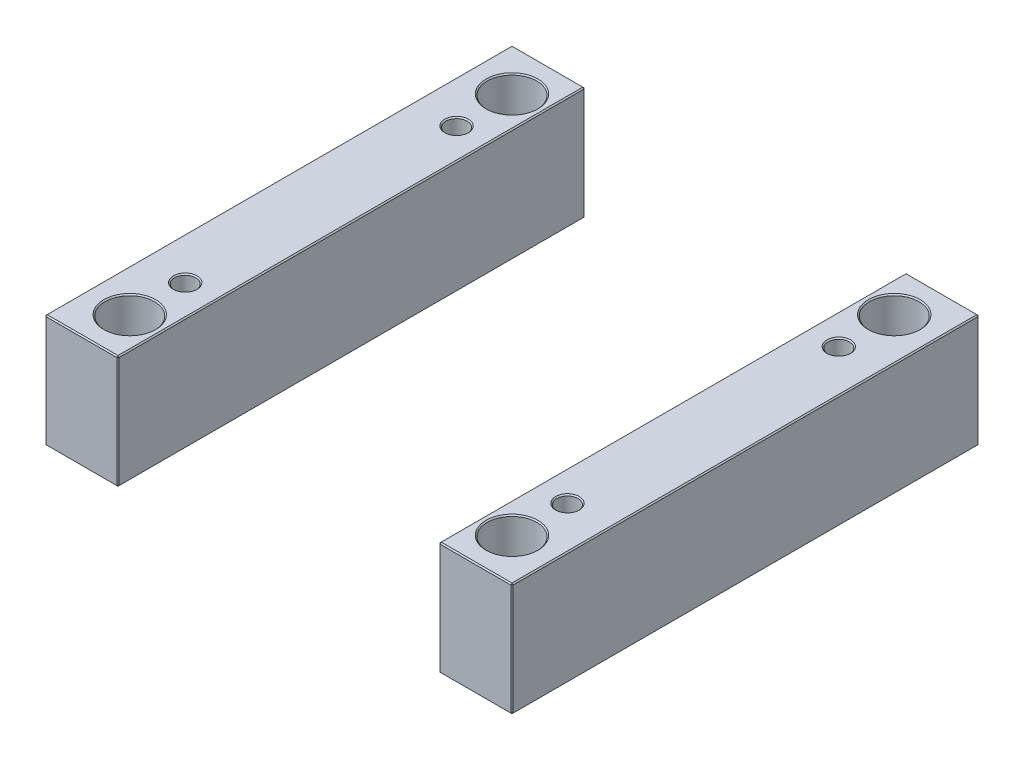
ISO-10303-21;
HEADER;
FILE_DESCRIPTION(('STEP AP214'),'2;1');
FILE_NAME('part.step','',(''),(''),'','','');
FILE_SCHEMA(('AUTOMOTIVE_DESIGN { 1 0 10303 214 1 1 1 1 }'));
ENDSEC;
DATA;
#1=APPLICATION_CONTEXT('core data for automotive mechanical design processes');
#2=APPLICATION_PROTOCOL_DEFINITION('international standard','automotive_design',2000,#1);
#3=PRODUCT_CONTEXT('',#1,'mechanical');
#4=PRODUCT('Part','Part','',(#3));
#5=PRODUCT_RELATED_PRODUCT_CATEGORY('part','',(#4));
#6=PRODUCT_DEFINITION_FORMATION('','',#4);
#7=PRODUCT_DEFINITION_CONTEXT('part definition',#1,'design');
#8=PRODUCT_DEFINITION('design','',#6,#7);
#9=PRODUCT_DEFINITION_SHAPE('','',#8);
#10=(LENGTH_UNIT() NAMED_UNIT(*) SI_UNIT(.MILLI.,.METRE.));
#11=(NAMED_UNIT(*) PLANE_ANGLE_UNIT() SI_UNIT($,.RADIAN.));
#12=(NAMED_UNIT(*) SI_UNIT($,.STERADIAN.) SOLID_ANGLE_UNIT());
#13=UNCERTAINTY_MEASURE_WITH_UNIT(LENGTH_MEASURE(1.E-05),#10,'distance_accuracy_value','');
#14=(GEOMETRIC_REPRESENTATION_CONTEXT(3) GLOBAL_UNCERTAINTY_ASSIGNED_CONTEXT((#13)) GLOBAL_UNIT_ASSIGNED_CONTEXT((#10,
#11,#12)) REPRESENTATION_CONTEXT('',''));
#15=CARTESIAN_POINT('',(0.,0.,0.));
#16=DIRECTION('',(0.,0.,1.));
#17=DIRECTION('',(1.,0.,0.));
#18=AXIS2_PLACEMENT_3D('',#15,#16,#17);
#19=CARTESIAN_POINT('',(-198.,96.,-198.));
#20=DIRECTION('',(0.,0.,1.));
#21=DIRECTION('',(1.,0.,0.));
#22=AXIS2_PLACEMENT_3D('',#19,#20,#21);
#23=PLANE('',#22);
#24=DIRECTION('',(-1.,0.,0.));
#25=VECTOR('',#24,1.);
#26=CARTESIAN_POINT('',(-198.,1.,-198.));
#27=LINE('',#26,#25);
#28=CARTESIAN_POINT('',(-137.,1.,-198.));
#29=VERTEX_POINT('',#28);
#30=CARTESIAN_POINT('',(-197.,1.,-198.));
#31=VERTEX_POINT('',#30);
#32=EDGE_CURVE('P0_E137',#29,#31,#27,.T.);
#33=ORIENTED_EDGE('',*,*,#32,.T.);
#34=DIRECTION('',(0.,1.,0.));
#35=VECTOR('',#34,1.);
#36=CARTESIAN_POINT('',(-197.,96.,-198.));
#37=LINE('',#36,#35);
#38=CARTESIAN_POINT('',(-197.,95.,-198.));
#39=VERTEX_POINT('',#38);
#40=EDGE_CURVE('P0_E265',#31,#39,#37,.T.);
#41=ORIENTED_EDGE('',*,*,#40,.T.);
#42=DIRECTION('',(1.,0.,0.));
#43=VECTOR('',#42,1.);
#44=CARTESIAN_POINT('',(-198.,95.,-198.));
#45=LINE('',#44,#43);
#46=CARTESIAN_POINT('',(-137.,95.,-198.));
#47=VERTEX_POINT('',#46);
#48=EDGE_CURVE('P0_E263',#39,#47,#45,.T.);
#49=ORIENTED_EDGE('',*,*,#48,.T.);
#50=DIRECTION('',(0.,-1.,0.));
#51=VECTOR('',#50,1.);
#52=CARTESIAN_POINT('',(-137.,96.,-198.));
#53=LINE('',#52,#51);
#54=EDGE_CURVE('P0_E260',#47,#29,#53,.T.);
#55=ORIENTED_EDGE('',*,*,#54,.T.);
#56=EDGE_LOOP('',(#33,#41,#49,#55));
#57=FACE_BOUND('',#56,.T.);
#58=ADVANCED_FACE('P0_F16',(#57),#23,.F.);
#59=CARTESIAN_POINT('',(-198.,96.,198.));
#60=DIRECTION('',(1.,0.,0.));
#61=DIRECTION('',(0.,0.,-1.));
#62=AXIS2_PLACEMENT_3D('',#59,#60,#61);
#63=PLANE('',#62);
#64=DIRECTION('',(0.,1.,0.));
#65=VECTOR('',#64,1.);
#66=CARTESIAN_POINT('',(-198.,96.,197.));
#67=LINE('',#66,#65);
#68=CARTESIAN_POINT('',(-198.,1.,197.));
#69=VERTEX_POINT('',#68);
#70=CARTESIAN_POINT('',(-198.,95.,197.));
#71=VERTEX_POINT('',#70);
#72=EDGE_CURVE('P0_E253',#69,#71,#67,.T.);
#73=ORIENTED_EDGE('',*,*,#72,.T.);
#74=DIRECTION('',(0.,0.,-1.));
#75=VECTOR('',#74,1.);
#76=CARTESIAN_POINT('',(-198.,95.,198.));
#77=LINE('',#76,#75);
#78=CARTESIAN_POINT('',(-198.,95.,-197.));
#79=VERTEX_POINT('',#78);
#80=EDGE_CURVE('P0_E258',#71,#79,#77,.T.);
#81=ORIENTED_EDGE('',*,*,#80,.T.);
#82=DIRECTION('',(0.,-1.,0.));
#83=VECTOR('',#82,1.);
#84=CARTESIAN_POINT('',(-198.,96.,-197.));
#85=LINE('',#84,#83);
#86=CARTESIAN_POINT('',(-198.,1.,-197.));
#87=VERTEX_POINT('',#86);
#88=EDGE_CURVE('P0_E255',#79,#87,#85,.T.);
#89=ORIENTED_EDGE('',*,*,#88,.T.);
#90=DIRECTION('',(0.,0.,1.));
#91=VECTOR('',#90,1.);
#92=CARTESIAN_POINT('',(-198.,1.,198.));
#93=LINE('',#92,#91);
#94=EDGE_CURVE('P0_E251',#87,#69,#93,.T.);
#95=ORIENTED_EDGE('',*,*,#94,.T.);
#96=EDGE_LOOP('',(#73,#81,#89,#95));
#97=FACE_BOUND('',#96,.T.);
#98=ADVANCED_FACE('P0_F333',(#97),#63,.F.);
#99=CARTESIAN_POINT('',(-198.,96.,198.));
#100=DIRECTION('',(0.,0.,-1.));
#101=DIRECTION('',(-1.,0.,0.));
#102=AXIS2_PLACEMENT_3D('',#99,#100,#101);
#103=PLANE('',#102);
#104=DIRECTION('',(-1.,0.,0.));
#105=VECTOR('',#104,1.);
#106=CARTESIAN_POINT('',(-198.,95.,198.));
#107=LINE('',#106,#105);
#108=CARTESIAN_POINT('',(-137.,95.,198.));
#109=VERTEX_POINT('',#108);
#110=CARTESIAN_POINT('',(-197.,95.,198.));
#111=VERTEX_POINT('',#110);
#112=EDGE_CURVE('P0_E272',#109,#111,#107,.T.);
#113=ORIENTED_EDGE('',*,*,#112,.T.);
#114=DIRECTION('',(0.,-1.,0.));
#115=VECTOR('',#114,1.);
#116=CARTESIAN_POINT('',(-197.,96.,198.));
#117=LINE('',#116,#115);
#118=CARTESIAN_POINT('',(-197.,1.,198.));
#119=VERTEX_POINT('',#118);
#120=EDGE_CURVE('P0_E274',#111,#119,#117,.T.);
#121=ORIENTED_EDGE('',*,*,#120,.T.);
#122=DIRECTION('',(1.,0.,0.));
#123=VECTOR('',#122,1.);
#124=CARTESIAN_POINT('',(-136.,1.,198.));
#125=LINE('',#124,#123);
#126=CARTESIAN_POINT('',(-137.,1.,198.));
#127=VERTEX_POINT('',#126);
#128=EDGE_CURVE('P0_E270',#119,#127,#125,.T.);
#129=ORIENTED_EDGE('',*,*,#128,.T.);
#130=DIRECTION('',(0.,1.,0.));
#131=VECTOR('',#130,1.);
#132=CARTESIAN_POINT('',(-137.,96.,198.));
#133=LINE('',#132,#131);
#134=EDGE_CURVE('P0_E268',#127,#109,#133,.T.);
#135=ORIENTED_EDGE('',*,*,#134,.T.);
#136=EDGE_LOOP('',(#113,#121,#129,#135));
#137=FACE_BOUND('',#136,.T.);
#138=ADVANCED_FACE('P0_F372',(#137),#103,.F.);
#139=CARTESIAN_POINT('',(-136.,96.,-198.));
#140=DIRECTION('',(-1.,0.,0.));
#141=DIRECTION('',(0.,0.,1.));
#142=AXIS2_PLACEMENT_3D('',#139,#140,#141);
#143=PLANE('',#142);
#144=DIRECTION('',(0.,0.,1.));
#145=VECTOR('',#144,1.);
#146=CARTESIAN_POINT('',(-136.,95.,-198.));
#147=LINE('',#146,#145);
#148=CARTESIAN_POINT('',(-136.,95.,-197.));
#149=VERTEX_POINT('',#148);
#150=CARTESIAN_POINT('',(-136.,95.,197.));
#151=VERTEX_POINT('',#150);
#152=EDGE_CURVE('P0_E31',#149,#151,#147,.T.);
#153=ORIENTED_EDGE('',*,*,#152,.T.);
#154=DIRECTION('',(0.,-1.,0.));
#155=VECTOR('',#154,1.);
#156=CARTESIAN_POINT('',(-136.,96.,197.));
#157=LINE('',#156,#155);
#158=CARTESIAN_POINT('',(-136.,1.,197.));
#159=VERTEX_POINT('',#158);
#160=EDGE_CURVE('P0_E190',#151,#159,#157,.T.);
#161=ORIENTED_EDGE('',*,*,#160,.T.);
#162=DIRECTION('',(0.,0.,-1.));
#163=VECTOR('',#162,1.);
#164=CARTESIAN_POINT('',(-136.,1.,-198.));
#165=LINE('',#164,#163);
#166=CARTESIAN_POINT('',(-136.,1.,-197.));
#167=VERTEX_POINT('',#166);
#168=EDGE_CURVE('P0_E286',#159,#167,#165,.T.);
#169=ORIENTED_EDGE('',*,*,#168,.T.);
#170=DIRECTION('',(0.,1.,0.));
#171=VECTOR('',#170,1.);
#172=CARTESIAN_POINT('',(-136.,96.,-197.));
#173=LINE('',#172,#171);
#174=EDGE_CURVE('P0_E36',#167,#149,#173,.T.);
#175=ORIENTED_EDGE('',*,*,#174,.T.);
#176=EDGE_LOOP('',(#153,#161,#169,#175));
#177=FACE_BOUND('',#176,.T.);
#178=ADVANCED_FACE('P0_F649',(#177),#143,.F.);
#179=CARTESIAN_POINT('',(0.,96.,0.));
#180=DIRECTION('',(0.,-1.,0.));
#181=DIRECTION('',(0.,0.,-1.));
#182=AXIS2_PLACEMENT_3D('',#179,#180,#181);
#183=PLANE('',#182);
#184=CARTESIAN_POINT('',(-162.,96.,-162.));
#185=DIRECTION('',(0.,-1.,0.));
#186=DIRECTION('',(0.,0.,-1.));
#187=AXIS2_PLACEMENT_3D('',#184,#185,#186);
#188=CIRCLE('',#187,22.);
#189=CARTESIAN_POINT('',(-162.,96.,-184.));
#190=VERTEX_POINT('',#189);
#191=EDGE_CURVE('P0_E214',#190,#190,#188,.T.);
#192=ORIENTED_EDGE('',*,*,#191,.T.);
#193=EDGE_LOOP('',(#192));
#194=FACE_BOUND('',#193,.T.);
#195=CARTESIAN_POINT('',(-162.,96.,162.));
#196=DIRECTION('',(0.,-1.,0.));
#197=DIRECTION('',(0.,0.,-1.));
#198=AXIS2_PLACEMENT_3D('',#195,#196,#197);
#199=CIRCLE('',#198,22.);
#200=CARTESIAN_POINT('',(-162.,96.,140.));
#201=VERTEX_POINT('',#200);
#202=EDGE_CURVE('P0_E211',#201,#201,#199,.T.);
#203=ORIENTED_EDGE('',*,*,#202,.T.);
#204=EDGE_LOOP('',(#203));
#205=FACE_BOUND('',#204,.T.);
#206=CARTESIAN_POINT('',(-162.,96.,115.));
#207=DIRECTION('',(0.,-1.,0.));
#208=DIRECTION('',(0.,0.,-1.));
#209=AXIS2_PLACEMENT_3D('',#206,#207,#208);
#210=CIRCLE('',#209,10.);
#211=CARTESIAN_POINT('',(-162.,96.,105.));
#212=VERTEX_POINT('',#211);
#213=EDGE_CURVE('P0_E193',#212,#212,#210,.T.);
#214=ORIENTED_EDGE('',*,*,#213,.T.);
#215=EDGE_LOOP('',(#214));
#216=FACE_BOUND('',#215,.T.);
#217=CARTESIAN_POINT('',(-162.,96.,-115.));
#218=DIRECTION('',(0.,-1.,0.));
#219=DIRECTION('',(0.,0.,-1.));
#220=AXIS2_PLACEMENT_3D('',#217,#218,#219);
#221=CIRCLE('',#220,10.);
#222=CARTESIAN_POINT('',(-162.,96.,-125.));
#223=VERTEX_POINT('',#222);
#224=EDGE_CURVE('P0_E189',#223,#223,#221,.T.);
#225=ORIENTED_EDGE('',*,*,#224,.T.);
#226=EDGE_LOOP('',(#225));
#227=FACE_BOUND('',#226,.T.);
#228=DIRECTION('',(0.,0.,1.));
#229=VECTOR('',#228,1.);
#230=CARTESIAN_POINT('',(-197.,96.,0.));
#231=LINE('',#230,#229);
#232=CARTESIAN_POINT('',(-197.,96.,-197.));
#233=VERTEX_POINT('',#232);
#234=CARTESIAN_POINT('',(-197.,96.,197.));
#235=VERTEX_POINT('',#234);
#236=EDGE_CURVE('P0_E281',#233,#235,#231,.T.);
#237=ORIENTED_EDGE('',*,*,#236,.T.);
#238=DIRECTION('',(1.,0.,0.));
#239=VECTOR('',#238,1.);
#240=CARTESIAN_POINT('',(-1.76382206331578E-13,96.,197.));
#241=LINE('',#240,#239);
#242=CARTESIAN_POINT('',(-137.,96.,197.));
#243=VERTEX_POINT('',#242);
#244=EDGE_CURVE('P0_E283',#235,#243,#241,.T.);
#245=ORIENTED_EDGE('',*,*,#244,.T.);
#246=DIRECTION('',(0.,0.,-1.));
#247=VECTOR('',#246,1.);
#248=CARTESIAN_POINT('',(-137.,96.,0.));
#249=LINE('',#248,#247);
#250=CARTESIAN_POINT('',(-137.,96.,-197.));
#251=VERTEX_POINT('',#250);
#252=EDGE_CURVE('P0_E277',#243,#251,#249,.T.);
#253=ORIENTED_EDGE('',*,*,#252,.T.);
#254=DIRECTION('',(-1.,0.,0.));
#255=VECTOR('',#254,1.);
#256=CARTESIAN_POINT('',(1.76382206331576E-13,96.,-197.));
#257=LINE('',#256,#255);
#258=EDGE_CURVE('P0_E279',#251,#233,#257,.T.);
#259=ORIENTED_EDGE('',*,*,#258,.T.);
#260=EDGE_LOOP('',(#237,#245,#253,#259));
#261=FACE_BOUND('',#260,.T.);
#262=ADVANCED_FACE('P0_F229',(#194,#205,#216,#227,#261),#183,.F.);
#263=CARTESIAN_POINT('',(0.,0.,0.));
#264=DIRECTION('',(0.,-1.,0.));
#265=DIRECTION('',(0.,0.,-1.));
#266=AXIS2_PLACEMENT_3D('',#263,#264,#265);
#267=PLANE('',#266);
#268=CARTESIAN_POINT('',(-162.,0.,-162.));
#269=DIRECTION('',(0.,-1.,0.));
#270=DIRECTION('',(0.,0.,-1.));
#271=AXIS2_PLACEMENT_3D('',#268,#269,#270);
#272=CIRCLE('',#271,22.);
#273=CARTESIAN_POINT('',(-162.,0.,-184.));
#274=VERTEX_POINT('',#273);
#275=EDGE_CURVE('P0_E202',#274,#274,#272,.F.);
#276=ORIENTED_EDGE('',*,*,#275,.T.);
#277=EDGE_LOOP('',(#276));
#278=FACE_BOUND('',#277,.T.);
#279=CARTESIAN_POINT('',(-162.,0.,162.));
#280=DIRECTION('',(0.,-1.,0.));
#281=DIRECTION('',(0.,0.,-1.));
#282=AXIS2_PLACEMENT_3D('',#279,#280,#281);
#283=CIRCLE('',#282,22.);
#284=CARTESIAN_POINT('',(-162.,0.,140.));
#285=VERTEX_POINT('',#284);
#286=EDGE_CURVE('P0_E199',#285,#285,#283,.F.);
#287=ORIENTED_EDGE('',*,*,#286,.T.);
#288=EDGE_LOOP('',(#287));
#289=FACE_BOUND('',#288,.T.);
#290=CARTESIAN_POINT('',(-162.,0.,-115.));
#291=DIRECTION('',(0.,-1.,0.));
#292=DIRECTION('',(0.,0.,-1.));
#293=AXIS2_PLACEMENT_3D('',#290,#291,#292);
#294=CIRCLE('',#293,10.);
#295=CARTESIAN_POINT('',(-162.,0.,-125.));
#296=VERTEX_POINT('',#295);
#297=EDGE_CURVE('P0_E235',#296,#296,#294,.F.);
#298=ORIENTED_EDGE('',*,*,#297,.T.);
#299=EDGE_LOOP('',(#298));
#300=FACE_BOUND('',#299,.T.);
#301=CARTESIAN_POINT('',(-162.,0.,115.));
#302=DIRECTION('',(0.,-1.,0.));
#303=DIRECTION('',(0.,0.,-1.));
#304=AXIS2_PLACEMENT_3D('',#301,#302,#303);
#305=CIRCLE('',#304,10.);
#306=CARTESIAN_POINT('',(-162.,0.,105.));
#307=VERTEX_POINT('',#306);
#308=EDGE_CURVE('P0_E238',#307,#307,#305,.F.);
#309=ORIENTED_EDGE('',*,*,#308,.T.);
#310=EDGE_LOOP('',(#309));
#311=FACE_BOUND('',#310,.T.);
#312=DIRECTION('',(-1.,0.,0.));
#313=VECTOR('',#312,1.);
#314=CARTESIAN_POINT('',(-198.,0.,197.));
#315=LINE('',#314,#313);
#316=CARTESIAN_POINT('',(-137.,0.,197.));
#317=VERTEX_POINT('',#316);
#318=CARTESIAN_POINT('',(-197.,0.,197.));
#319=VERTEX_POINT('',#318);
#320=EDGE_CURVE('P0_E114',#317,#319,#315,.T.);
#321=ORIENTED_EDGE('',*,*,#320,.T.);
#322=DIRECTION('',(0.,0.,-1.));
#323=VECTOR('',#322,1.);
#324=CARTESIAN_POINT('',(-197.,0.,-198.));
#325=LINE('',#324,#323);
#326=CARTESIAN_POINT('',(-197.,0.,-197.));
#327=VERTEX_POINT('',#326);
#328=EDGE_CURVE('P0_E110',#319,#327,#325,.T.);
#329=ORIENTED_EDGE('',*,*,#328,.T.);
#330=DIRECTION('',(1.,0.,0.));
#331=VECTOR('',#330,1.);
#332=CARTESIAN_POINT('',(-136.,0.,-197.));
#333=LINE('',#332,#331);
#334=CARTESIAN_POINT('',(-137.,0.,-197.));
#335=VERTEX_POINT('',#334);
#336=EDGE_CURVE('P0_E104',#327,#335,#333,.T.);
#337=ORIENTED_EDGE('',*,*,#336,.T.);
#338=DIRECTION('',(0.,0.,1.));
#339=VECTOR('',#338,1.);
#340=CARTESIAN_POINT('',(-137.,0.,198.));
#341=LINE('',#340,#339);
#342=EDGE_CURVE('P0_E107',#335,#317,#341,.T.);
#343=ORIENTED_EDGE('',*,*,#342,.T.);
#344=EDGE_LOOP('',(#321,#329,#337,#343));
#345=FACE_BOUND('',#344,.T.);
#346=ADVANCED_FACE('P0_F106',(#278,#289,#300,#311,#345),#267,.T.);
#347=CARTESIAN_POINT('',(-162.,0.,-115.));
#348=DIRECTION('',(0.,1.,0.));
#349=DIRECTION('',(0.,0.,1.));
#350=AXIS2_PLACEMENT_3D('',#347,#348,#349);
#351=CYLINDRICAL_SURFACE('',#350,9.);
#352=CARTESIAN_POINT('',(-162.,95.,-115.));
#353=DIRECTION('',(0.,-1.,0.));
#354=DIRECTION('',(0.,0.,-1.));
#355=AXIS2_PLACEMENT_3D('',#352,#353,#354);
#356=CIRCLE('',#355,9.);
#357=CARTESIAN_POINT('',(-162.,95.,-124.));
#358=VERTEX_POINT('',#357);
#359=EDGE_CURVE('P0_E196',#358,#358,#356,.F.);
#360=ORIENTED_EDGE('',*,*,#359,.T.);
#361=EDGE_LOOP('',(#360));
#362=FACE_BOUND('',#361,.T.);
#363=CARTESIAN_POINT('',(-162.,0.999999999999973,-115.));
#364=DIRECTION('',(0.,-1.,0.));
#365=DIRECTION('',(0.,0.,-1.));
#366=AXIS2_PLACEMENT_3D('',#363,#364,#365);
#367=CIRCLE('',#366,9.);
#368=CARTESIAN_POINT('',(-162.,0.999999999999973,-124.));
#369=VERTEX_POINT('',#368);
#370=EDGE_CURVE('P0_E241',#369,#369,#367,.T.);
#371=ORIENTED_EDGE('',*,*,#370,.T.);
#372=EDGE_LOOP('',(#371));
#373=FACE_BOUND('',#372,.T.);
#374=ADVANCED_FACE('P0_F228',(#362,#373),#351,.F.);
#375=CARTESIAN_POINT('',(-162.,0.,115.));
#376=DIRECTION('',(0.,1.,0.));
#377=DIRECTION('',(0.,0.,1.));
#378=AXIS2_PLACEMENT_3D('',#375,#376,#377);
#379=CYLINDRICAL_SURFACE('',#378,9.);
#380=CARTESIAN_POINT('',(-162.,95.,115.));
#381=DIRECTION('',(0.,-1.,0.));
#382=DIRECTION('',(0.,0.,-1.));
#383=AXIS2_PLACEMENT_3D('',#380,#381,#382);
#384=CIRCLE('',#383,9.);
#385=CARTESIAN_POINT('',(-162.,95.,106.));
#386=VERTEX_POINT('',#385);
#387=EDGE_CURVE('P0_E186',#386,#386,#384,.F.);
#388=ORIENTED_EDGE('',*,*,#387,.T.);
#389=EDGE_LOOP('',(#388));
#390=FACE_BOUND('',#389,.T.);
#391=CARTESIAN_POINT('',(-162.,0.999999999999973,115.));
#392=DIRECTION('',(0.,-1.,0.));
#393=DIRECTION('',(0.,0.,-1.));
#394=AXIS2_PLACEMENT_3D('',#391,#392,#393);
#395=CIRCLE('',#394,9.);
#396=CARTESIAN_POINT('',(-162.,0.999999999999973,106.));
#397=VERTEX_POINT('',#396);
#398=EDGE_CURVE('P0_E248',#397,#397,#395,.T.);
#399=ORIENTED_EDGE('',*,*,#398,.T.);
#400=EDGE_LOOP('',(#399));
#401=FACE_BOUND('',#400,.T.);
#402=ADVANCED_FACE('P0_F380',(#390,#401),#379,.F.);
#403=CARTESIAN_POINT('',(-162.,0.,-115.));
#404=DIRECTION('',(0.,-1.,0.));
#405=DIRECTION('',(0.,0.,-1.));
#406=AXIS2_PLACEMENT_3D('',#403,#404,#405);
#407=CONICAL_SURFACE('',#406,10.,0.785398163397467);
#408=ORIENTED_EDGE('',*,*,#370,.F.);
#409=EDGE_LOOP('',(#408));
#410=FACE_BOUND('',#409,.T.);
#411=ORIENTED_EDGE('',*,*,#297,.F.);
#412=EDGE_LOOP('',(#411));
#413=FACE_BOUND('',#412,.T.);
#414=ADVANCED_FACE('P0_F376',(#410,#413),#407,.F.);
#415=CARTESIAN_POINT('',(-162.,0.,115.));
#416=DIRECTION('',(0.,-1.,0.));
#417=DIRECTION('',(0.,0.,-1.));
#418=AXIS2_PLACEMENT_3D('',#415,#416,#417);
#419=CONICAL_SURFACE('',#418,10.,0.78539816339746);
#420=ORIENTED_EDGE('',*,*,#398,.F.);
#421=EDGE_LOOP('',(#420));
#422=FACE_BOUND('',#421,.T.);
#423=ORIENTED_EDGE('',*,*,#308,.F.);
#424=EDGE_LOOP('',(#423));
#425=FACE_BOUND('',#424,.T.);
#426=ADVANCED_FACE('P0_F379',(#422,#425),#419,.F.);
#427=CARTESIAN_POINT('',(-136.,96.,197.));
#428=DIRECTION('',(-0.707106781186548,0.,-0.707106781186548));
#429=DIRECTION('',(0.,-1.,0.));
#430=AXIS2_PLACEMENT_3D('',#427,#428,#429);
#431=PLANE('',#430);
#432=DIRECTION('',(-0.707106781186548,0.,0.707106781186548));
#433=VECTOR('',#432,1.);
#434=CARTESIAN_POINT('',(-136.5,95.,197.5));
#435=LINE('',#434,#433);
#436=EDGE_CURVE('P0_E125',#109,#151,#435,.F.);
#437=ORIENTED_EDGE('',*,*,#436,.F.);
#438=ORIENTED_EDGE('',*,*,#134,.F.);
#439=DIRECTION('',(0.707106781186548,0.,-0.707106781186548));
#440=VECTOR('',#439,1.);
#441=CARTESIAN_POINT('',(-137.,1.,198.));
#442=LINE('',#441,#440);
#443=EDGE_CURVE('P0_E181',#159,#127,#442,.F.);
#444=ORIENTED_EDGE('',*,*,#443,.F.);
#445=ORIENTED_EDGE('',*,*,#160,.F.);
#446=EDGE_LOOP('',(#437,#438,#444,#445));
#447=FACE_BOUND('',#446,.T.);
#448=ADVANCED_FACE('P0_F384',(#447),#431,.F.);
#449=CARTESIAN_POINT('',(-137.,96.,197.));
#450=DIRECTION('',(0.577350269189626,0.577350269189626,0.577350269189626));
#451=DIRECTION('',(0.707106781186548,0.,-0.707106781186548));
#452=AXIS2_PLACEMENT_3D('',#449,#450,#451);
#453=PLANE('',#452);
#454=DIRECTION('',(0.,0.707106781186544,-0.707106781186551));
#455=VECTOR('',#454,1.);
#456=CARTESIAN_POINT('',(-137.,96.,197.));
#457=LINE('',#456,#455);
#458=EDGE_CURVE('P0_E175',#109,#243,#457,.T.);
#459=ORIENTED_EDGE('',*,*,#458,.F.);
#460=ORIENTED_EDGE('',*,*,#436,.T.);
#461=DIRECTION('',(0.707106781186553,-0.707106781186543,0.));
#462=VECTOR('',#461,1.);
#463=CARTESIAN_POINT('',(-137.,96.,197.));
#464=LINE('',#463,#462);
#465=EDGE_CURVE('P0_E178',#243,#151,#464,.T.);
#466=ORIENTED_EDGE('',*,*,#465,.F.);
#467=EDGE_LOOP('',(#459,#460,#466));
#468=FACE_BOUND('',#467,.T.);
#469=ADVANCED_FACE('P0_F588',(#468),#453,.T.);
#470=CARTESIAN_POINT('',(-137.,1.,198.));
#471=DIRECTION('',(0.57735026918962,-0.577350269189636,0.57735026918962));
#472=DIRECTION('',(0.,-0.707106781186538,-0.707106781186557));
#473=AXIS2_PLACEMENT_3D('',#470,#471,#472);
#474=PLANE('',#473);
#475=DIRECTION('',(0.707106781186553,0.707106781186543,0.));
#476=VECTOR('',#475,1.);
#477=CARTESIAN_POINT('',(-136.5,0.500000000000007,197.));
#478=LINE('',#477,#476);
#479=EDGE_CURVE('P0_E123',#159,#317,#478,.F.);
#480=ORIENTED_EDGE('',*,*,#479,.F.);
#481=ORIENTED_EDGE('',*,*,#443,.T.);
#482=DIRECTION('',(0.,-0.707106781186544,-0.707106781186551));
#483=VECTOR('',#482,1.);
#484=CARTESIAN_POINT('',(-137.,1.,198.));
#485=LINE('',#484,#483);
#486=EDGE_CURVE('P0_E172',#317,#127,#485,.F.);
#487=ORIENTED_EDGE('',*,*,#486,.F.);
#488=EDGE_LOOP('',(#480,#481,#487));
#489=FACE_BOUND('',#488,.T.);
#490=ADVANCED_FACE('P0_F597',(#489),#474,.T.);
#491=CARTESIAN_POINT('',(-137.,96.,0.));
#492=DIRECTION('',(-0.707106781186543,-0.707106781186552,0.));
#493=DIRECTION('',(0.,0.,-1.));
#494=AXIS2_PLACEMENT_3D('',#491,#492,#493);
#495=PLANE('',#494);
#496=ORIENTED_EDGE('',*,*,#465,.T.);
#497=ORIENTED_EDGE('',*,*,#152,.F.);
#498=DIRECTION('',(-0.707106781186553,0.707106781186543,0.));
#499=VECTOR('',#498,1.);
#500=CARTESIAN_POINT('',(-136.5,95.5,-197.));
#501=LINE('',#500,#499);
#502=EDGE_CURVE('P0_E165',#251,#149,#501,.F.);
#503=ORIENTED_EDGE('',*,*,#502,.F.);
#504=ORIENTED_EDGE('',*,*,#252,.F.);
#505=EDGE_LOOP('',(#496,#497,#503,#504));
#506=FACE_BOUND('',#505,.T.);
#507=ADVANCED_FACE('P0_F349',(#506),#495,.F.);
#508=CARTESIAN_POINT('',(-1.76382206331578E-13,96.,197.));
#509=DIRECTION('',(0.,-0.707106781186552,-0.707106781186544));
#510=DIRECTION('',(1.,0.,0.));
#511=AXIS2_PLACEMENT_3D('',#508,#509,#510);
#512=PLANE('',#511);
#513=ORIENTED_EDGE('',*,*,#458,.T.);
#514=ORIENTED_EDGE('',*,*,#244,.F.);
#515=DIRECTION('',(0.,-0.707106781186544,0.707106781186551));
#516=VECTOR('',#515,1.);
#517=CARTESIAN_POINT('',(-197.,95.5,197.5));
#518=LINE('',#517,#516);
#519=EDGE_CURVE('P0_E162',#111,#235,#518,.F.);
#520=ORIENTED_EDGE('',*,*,#519,.F.);
#521=ORIENTED_EDGE('',*,*,#112,.F.);
#522=EDGE_LOOP('',(#513,#514,#520,#521));
#523=FACE_BOUND('',#522,.T.);
#524=ADVANCED_FACE('P0_F344',(#523),#512,.F.);
#525=CARTESIAN_POINT('',(-197.,96.,198.));
#526=DIRECTION('',(0.707106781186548,0.,-0.707106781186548));
#527=DIRECTION('',(0.,-1.,0.));
#528=AXIS2_PLACEMENT_3D('',#525,#526,#527);
#529=PLANE('',#528);
#530=DIRECTION('',(0.707106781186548,0.,0.707106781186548));
#531=VECTOR('',#530,1.);
#532=CARTESIAN_POINT('',(-197.,1.,198.));
#533=LINE('',#532,#531);
#534=EDGE_CURVE('P0_E156',#119,#69,#533,.F.);
#535=ORIENTED_EDGE('',*,*,#534,.F.);
#536=ORIENTED_EDGE('',*,*,#120,.F.);
#537=DIRECTION('',(-0.707106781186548,0.,-0.707106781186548));
#538=VECTOR('',#537,1.);
#539=CARTESIAN_POINT('',(-198.,95.,197.));
#540=LINE('',#539,#538);
#541=EDGE_CURVE('P0_E159',#71,#111,#540,.F.);
#542=ORIENTED_EDGE('',*,*,#541,.F.);
#543=ORIENTED_EDGE('',*,*,#72,.F.);
#544=EDGE_LOOP('',(#535,#536,#542,#543));
#545=FACE_BOUND('',#544,.T.);
#546=ADVANCED_FACE('P0_F338',(#545),#529,.F.);
#547=CARTESIAN_POINT('',(-198.,1.,198.));
#548=DIRECTION('',(0.,-0.707106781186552,0.707106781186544));
#549=DIRECTION('',(-1.,0.,0.));
#550=AXIS2_PLACEMENT_3D('',#547,#548,#549);
#551=PLANE('',#550);
#552=ORIENTED_EDGE('',*,*,#486,.T.);
#553=ORIENTED_EDGE('',*,*,#128,.F.);
#554=DIRECTION('',(0.,0.707106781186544,0.707106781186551));
#555=VECTOR('',#554,1.);
#556=CARTESIAN_POINT('',(-197.,1.,198.));
#557=LINE('',#556,#555);
#558=EDGE_CURVE('P0_E134',#319,#119,#557,.T.);
#559=ORIENTED_EDGE('',*,*,#558,.F.);
#560=ORIENTED_EDGE('',*,*,#320,.F.);
#561=EDGE_LOOP('',(#552,#553,#559,#560));
#562=FACE_BOUND('',#561,.T.);
#563=ADVANCED_FACE('P0_F364',(#562),#551,.T.);
#564=CARTESIAN_POINT('',(-136.,1.,-198.));
#565=DIRECTION('',(0.707106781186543,-0.707106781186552,0.));
#566=DIRECTION('',(0.,0.,1.));
#567=AXIS2_PLACEMENT_3D('',#564,#565,#566);
#568=PLANE('',#567);
#569=ORIENTED_EDGE('',*,*,#479,.T.);
#570=ORIENTED_EDGE('',*,*,#342,.F.);
#571=DIRECTION('',(-0.707106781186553,-0.707106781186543,0.));
#572=VECTOR('',#571,1.);
#573=CARTESIAN_POINT('',(-137.,0.,-197.));
#574=LINE('',#573,#572);
#575=EDGE_CURVE('P0_E120',#167,#335,#574,.T.);
#576=ORIENTED_EDGE('',*,*,#575,.F.);
#577=ORIENTED_EDGE('',*,*,#168,.F.);
#578=EDGE_LOOP('',(#569,#570,#576,#577));
#579=FACE_BOUND('',#578,.T.);
#580=ADVANCED_FACE('P0_F119',(#579),#568,.T.);
#581=CARTESIAN_POINT('',(-137.,96.,-198.));
#582=DIRECTION('',(-0.707106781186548,0.,0.707106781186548));
#583=DIRECTION('',(0.,-1.,0.));
#584=AXIS2_PLACEMENT_3D('',#581,#582,#583);
#585=PLANE('',#584);
#586=DIRECTION('',(0.707106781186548,0.,0.707106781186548));
#587=VECTOR('',#586,1.);
#588=CARTESIAN_POINT('',(-137.,95.,-198.));
#589=LINE('',#588,#587);
#590=EDGE_CURVE('P0_E168',#149,#47,#589,.F.);
#591=ORIENTED_EDGE('',*,*,#590,.F.);
#592=ORIENTED_EDGE('',*,*,#174,.F.);
#593=DIRECTION('',(-0.707106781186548,0.,-0.707106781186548));
#594=VECTOR('',#593,1.);
#595=CARTESIAN_POINT('',(-136.5,1.,-197.5));
#596=LINE('',#595,#594);
#597=EDGE_CURVE('P0_E133',#29,#167,#596,.F.);
#598=ORIENTED_EDGE('',*,*,#597,.F.);
#599=ORIENTED_EDGE('',*,*,#54,.F.);
#600=EDGE_LOOP('',(#591,#592,#598,#599));
#601=FACE_BOUND('',#600,.T.);
#602=ADVANCED_FACE('P0_F354',(#601),#585,.F.);
#603=CARTESIAN_POINT('',(-137.,95.,-198.));
#604=DIRECTION('',(0.577350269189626,0.577350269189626,-0.577350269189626));
#605=DIRECTION('',(-0.707106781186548,0.,-0.707106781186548));
#606=AXIS2_PLACEMENT_3D('',#603,#604,#605);
#607=PLANE('',#606);
#608=ORIENTED_EDGE('',*,*,#502,.T.);
#609=ORIENTED_EDGE('',*,*,#590,.T.);
#610=DIRECTION('',(0.,-0.707106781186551,-0.707106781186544));
#611=VECTOR('',#610,1.);
#612=CARTESIAN_POINT('',(-137.,95.,-198.));
#613=LINE('',#612,#611);
#614=EDGE_CURVE('P0_E151',#251,#47,#613,.T.);
#615=ORIENTED_EDGE('',*,*,#614,.F.);
#616=EDGE_LOOP('',(#608,#609,#615));
#617=FACE_BOUND('',#616,.T.);
#618=ADVANCED_FACE('P0_F352',(#617),#607,.T.);
#619=CARTESIAN_POINT('',(-198.,95.,197.));
#620=DIRECTION('',(-0.577350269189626,0.577350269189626,0.577350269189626));
#621=DIRECTION('',(0.707106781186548,0.,0.707106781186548));
#622=AXIS2_PLACEMENT_3D('',#619,#620,#621);
#623=PLANE('',#622);
#624=ORIENTED_EDGE('',*,*,#541,.T.);
#625=ORIENTED_EDGE('',*,*,#519,.T.);
#626=DIRECTION('',(0.707106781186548,0.707106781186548,0.));
#627=VECTOR('',#626,1.);
#628=CARTESIAN_POINT('',(-198.,95.,197.));
#629=LINE('',#628,#627);
#630=EDGE_CURVE('P0_E142',#71,#235,#629,.T.);
#631=ORIENTED_EDGE('',*,*,#630,.F.);
#632=EDGE_LOOP('',(#624,#625,#631));
#633=FACE_BOUND('',#632,.T.);
#634=ADVANCED_FACE('P0_F341',(#633),#623,.T.);
#635=CARTESIAN_POINT('',(-197.,1.,198.));
#636=DIRECTION('',(-0.577350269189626,-0.577350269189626,0.577350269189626));
#637=DIRECTION('',(0.707106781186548,0.,0.707106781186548));
#638=AXIS2_PLACEMENT_3D('',#635,#636,#637);
#639=PLANE('',#638);
#640=ORIENTED_EDGE('',*,*,#558,.T.);
#641=ORIENTED_EDGE('',*,*,#534,.T.);
#642=DIRECTION('',(0.707106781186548,-0.707106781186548,0.));
#643=VECTOR('',#642,1.);
#644=CARTESIAN_POINT('',(-197.5,0.5,197.));
#645=LINE('',#644,#643);
#646=EDGE_CURVE('P0_E138',#319,#69,#645,.F.);
#647=ORIENTED_EDGE('',*,*,#646,.F.);
#648=EDGE_LOOP('',(#640,#641,#647));
#649=FACE_BOUND('',#648,.T.);
#650=ADVANCED_FACE('P0_F403',(#649),#639,.T.);
#651=CARTESIAN_POINT('',(-137.,0.,-197.));
#652=DIRECTION('',(0.57735026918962,-0.577350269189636,-0.57735026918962));
#653=DIRECTION('',(0.,0.707106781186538,-0.707106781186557));
#654=AXIS2_PLACEMENT_3D('',#651,#652,#653);
#655=PLANE('',#654);
#656=ORIENTED_EDGE('',*,*,#597,.T.);
#657=ORIENTED_EDGE('',*,*,#575,.T.);
#658=DIRECTION('',(0.,0.707106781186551,-0.707106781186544));
#659=VECTOR('',#658,1.);
#660=CARTESIAN_POINT('',(-137.,0.,-197.));
#661=LINE('',#660,#659);
#662=EDGE_CURVE('P0_E130',#29,#335,#661,.F.);
#663=ORIENTED_EDGE('',*,*,#662,.F.);
#664=EDGE_LOOP('',(#656,#657,#663));
#665=FACE_BOUND('',#664,.T.);
#666=ADVANCED_FACE('P0_F129',(#665),#655,.T.);
#667=CARTESIAN_POINT('',(1.76382206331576E-13,96.,-197.));
#668=DIRECTION('',(0.,-0.707106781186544,0.707106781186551));
#669=DIRECTION('',(-1.,0.,0.));
#670=AXIS2_PLACEMENT_3D('',#667,#668,#669);
#671=PLANE('',#670);
#672=ORIENTED_EDGE('',*,*,#614,.T.);
#673=ORIENTED_EDGE('',*,*,#48,.F.);
#674=DIRECTION('',(0.,0.707106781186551,0.707106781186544));
#675=VECTOR('',#674,1.);
#676=CARTESIAN_POINT('',(-197.,95.,-198.));
#677=LINE('',#676,#675);
#678=EDGE_CURVE('P0_E139',#233,#39,#677,.F.);
#679=ORIENTED_EDGE('',*,*,#678,.F.);
#680=ORIENTED_EDGE('',*,*,#258,.F.);
#681=EDGE_LOOP('',(#672,#673,#679,#680));
#682=FACE_BOUND('',#681,.T.);
#683=ADVANCED_FACE('P0_F316',(#682),#671,.F.);
#684=CARTESIAN_POINT('',(-197.,96.,0.));
#685=DIRECTION('',(0.707106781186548,-0.707106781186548,0.));
#686=DIRECTION('',(0.,0.,1.));
#687=AXIS2_PLACEMENT_3D('',#684,#685,#686);
#688=PLANE('',#687);
#689=ORIENTED_EDGE('',*,*,#630,.T.);
#690=ORIENTED_EDGE('',*,*,#236,.F.);
#691=DIRECTION('',(-0.707106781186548,-0.707106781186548,0.));
#692=VECTOR('',#691,1.);
#693=CARTESIAN_POINT('',(-197.5,95.5,-197.));
#694=LINE('',#693,#692);
#695=EDGE_CURVE('P0_E145',#79,#233,#694,.F.);
#696=ORIENTED_EDGE('',*,*,#695,.F.);
#697=ORIENTED_EDGE('',*,*,#80,.F.);
#698=EDGE_LOOP('',(#689,#690,#696,#697));
#699=FACE_BOUND('',#698,.T.);
#700=ADVANCED_FACE('P0_F310',(#699),#688,.F.);
#701=CARTESIAN_POINT('',(-198.,1.,198.));
#702=DIRECTION('',(-0.707106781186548,-0.707106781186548,0.));
#703=DIRECTION('',(0.,0.,-1.));
#704=AXIS2_PLACEMENT_3D('',#701,#702,#703);
#705=PLANE('',#704);
#706=ORIENTED_EDGE('',*,*,#646,.T.);
#707=ORIENTED_EDGE('',*,*,#94,.F.);
#708=DIRECTION('',(-0.707106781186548,0.707106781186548,0.));
#709=VECTOR('',#708,1.);
#710=CARTESIAN_POINT('',(-198.,1.,-197.));
#711=LINE('',#710,#709);
#712=EDGE_CURVE('P0_E297',#327,#87,#711,.T.);
#713=ORIENTED_EDGE('',*,*,#712,.F.);
#714=ORIENTED_EDGE('',*,*,#328,.F.);
#715=EDGE_LOOP('',(#706,#707,#713,#714));
#716=FACE_BOUND('',#715,.T.);
#717=ADVANCED_FACE('P0_F329',(#716),#705,.T.);
#718=CARTESIAN_POINT('',(-198.,1.,-198.));
#719=DIRECTION('',(0.,-0.707106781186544,-0.707106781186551));
#720=DIRECTION('',(1.,0.,0.));
#721=AXIS2_PLACEMENT_3D('',#718,#719,#720);
#722=PLANE('',#721);
#723=ORIENTED_EDGE('',*,*,#662,.T.);
#724=ORIENTED_EDGE('',*,*,#336,.F.);
#725=DIRECTION('',(0.,-0.707106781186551,0.707106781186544));
#726=VECTOR('',#725,1.);
#727=CARTESIAN_POINT('',(-197.,0.500000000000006,-197.5));
#728=LINE('',#727,#726);
#729=EDGE_CURVE('P0_E295',#31,#327,#728,.T.);
#730=ORIENTED_EDGE('',*,*,#729,.F.);
#731=ORIENTED_EDGE('',*,*,#32,.F.);
#732=EDGE_LOOP('',(#723,#724,#730,#731));
#733=FACE_BOUND('',#732,.T.);
#734=ADVANCED_FACE('P0_F136',(#733),#722,.T.);
#735=CARTESIAN_POINT('',(-197.,95.,-198.));
#736=DIRECTION('',(-0.577350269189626,0.577350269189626,-0.577350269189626));
#737=DIRECTION('',(-0.707106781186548,0.,0.707106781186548));
#738=AXIS2_PLACEMENT_3D('',#735,#736,#737);
#739=PLANE('',#738);
#740=ORIENTED_EDGE('',*,*,#695,.T.);
#741=ORIENTED_EDGE('',*,*,#678,.T.);
#742=DIRECTION('',(0.707106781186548,0.,-0.707106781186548));
#743=VECTOR('',#742,1.);
#744=CARTESIAN_POINT('',(-197.,95.,-198.));
#745=LINE('',#744,#743);
#746=EDGE_CURVE('P0_E293',#79,#39,#745,.T.);
#747=ORIENTED_EDGE('',*,*,#746,.F.);
#748=EDGE_LOOP('',(#740,#741,#747));
#749=FACE_BOUND('',#748,.T.);
#750=ADVANCED_FACE('P0_F303',(#749),#739,.T.);
#751=CARTESIAN_POINT('',(-198.,1.,-197.));
#752=DIRECTION('',(-0.577350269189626,-0.577350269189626,-0.577350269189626));
#753=DIRECTION('',(-0.707106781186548,0.,0.707106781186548));
#754=AXIS2_PLACEMENT_3D('',#751,#752,#753);
#755=PLANE('',#754);
#756=ORIENTED_EDGE('',*,*,#729,.T.);
#757=ORIENTED_EDGE('',*,*,#712,.T.);
#758=DIRECTION('',(-0.707106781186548,0.,0.707106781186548));
#759=VECTOR('',#758,1.);
#760=CARTESIAN_POINT('',(-198.,1.,-197.));
#761=LINE('',#760,#759);
#762=EDGE_CURVE('P0_E291',#31,#87,#761,.T.);
#763=ORIENTED_EDGE('',*,*,#762,.F.);
#764=EDGE_LOOP('',(#756,#757,#763));
#765=FACE_BOUND('',#764,.T.);
#766=ADVANCED_FACE('P0_F325',(#765),#755,.T.);
#767=CARTESIAN_POINT('',(-198.,96.,-197.));
#768=DIRECTION('',(0.707106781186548,0.,0.707106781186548));
#769=DIRECTION('',(0.,-1.,0.));
#770=AXIS2_PLACEMENT_3D('',#767,#768,#769);
#771=PLANE('',#770);
#772=ORIENTED_EDGE('',*,*,#746,.T.);
#773=ORIENTED_EDGE('',*,*,#40,.F.);
#774=ORIENTED_EDGE('',*,*,#762,.T.);
#775=ORIENTED_EDGE('',*,*,#88,.F.);
#776=EDGE_LOOP('',(#772,#773,#774,#775));
#777=FACE_BOUND('',#776,.T.);
#778=ADVANCED_FACE('P0_F323',(#777),#771,.F.);
#779=CARTESIAN_POINT('',(-162.,95.,115.));
#780=DIRECTION('',(0.,1.,0.));
#781=DIRECTION('',(0.,0.,1.));
#782=AXIS2_PLACEMENT_3D('',#779,#780,#781);
#783=CONICAL_SURFACE('',#782,9.,0.785398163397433);
#784=ORIENTED_EDGE('',*,*,#213,.F.);
#785=EDGE_LOOP('',(#784));
#786=FACE_BOUND('',#785,.T.);
#787=ORIENTED_EDGE('',*,*,#387,.F.);
#788=EDGE_LOOP('',(#787));
#789=FACE_BOUND('',#788,.T.);
#790=ADVANCED_FACE('P0_F388',(#786,#789),#783,.F.);
#791=CARTESIAN_POINT('',(-162.,95.,-115.));
#792=DIRECTION('',(0.,1.,0.));
#793=DIRECTION('',(0.,0.,1.));
#794=AXIS2_PLACEMENT_3D('',#791,#792,#793);
#795=CONICAL_SURFACE('',#794,9.,0.78539816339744);
#796=ORIENTED_EDGE('',*,*,#224,.F.);
#797=EDGE_LOOP('',(#796));
#798=FACE_BOUND('',#797,.T.);
#799=ORIENTED_EDGE('',*,*,#359,.F.);
#800=EDGE_LOOP('',(#799));
#801=FACE_BOUND('',#800,.T.);
#802=ADVANCED_FACE('P0_F470',(#798,#801),#795,.F.);
#803=CARTESIAN_POINT('',(-162.,0.,162.));
#804=DIRECTION('',(0.,1.,0.));
#805=DIRECTION('',(0.,0.,1.));
#806=AXIS2_PLACEMENT_3D('',#803,#804,#805);
#807=CYLINDRICAL_SURFACE('',#806,21.);
#808=CARTESIAN_POINT('',(-162.,95.,162.));
#809=DIRECTION('',(0.,-1.,0.));
#810=DIRECTION('',(0.,0.,-1.));
#811=AXIS2_PLACEMENT_3D('',#808,#809,#810);
#812=CIRCLE('',#811,21.);
#813=CARTESIAN_POINT('',(-162.,95.,141.));
#814=VERTEX_POINT('',#813);
#815=EDGE_CURVE('P0_E10',#814,#814,#812,.F.);
#816=ORIENTED_EDGE('',*,*,#815,.T.);
#817=EDGE_LOOP('',(#816));
#818=FACE_BOUND('',#817,.T.);
#819=CARTESIAN_POINT('',(-162.,1.,162.));
#820=DIRECTION('',(0.,-1.,0.));
#821=DIRECTION('',(0.,0.,-1.));
#822=AXIS2_PLACEMENT_3D('',#819,#820,#821);
#823=CIRCLE('',#822,21.);
#824=CARTESIAN_POINT('',(-162.,1.,141.));
#825=VERTEX_POINT('',#824);
#826=EDGE_CURVE('P0_E24',#825,#825,#823,.T.);
#827=ORIENTED_EDGE('',*,*,#826,.T.);
#828=EDGE_LOOP('',(#827));
#829=FACE_BOUND('',#828,.T.);
#830=ADVANCED_FACE('P0_F219',(#818,#829),#807,.F.);
#831=CARTESIAN_POINT('',(-162.,0.,-162.));
#832=DIRECTION('',(0.,1.,0.));
#833=DIRECTION('',(0.,0.,1.));
#834=AXIS2_PLACEMENT_3D('',#831,#832,#833);
#835=CYLINDRICAL_SURFACE('',#834,21.);
#836=CARTESIAN_POINT('',(-162.,1.,-162.));
#837=DIRECTION('',(0.,-1.,0.));
#838=DIRECTION('',(0.,0.,-1.));
#839=AXIS2_PLACEMENT_3D('',#836,#837,#838);
#840=CIRCLE('',#839,21.);
#841=CARTESIAN_POINT('',(-162.,1.,-183.));
#842=VERTEX_POINT('',#841);
#843=EDGE_CURVE('P0_E208',#842,#842,#840,.T.);
#844=ORIENTED_EDGE('',*,*,#843,.T.);
#845=EDGE_LOOP('',(#844));
#846=FACE_BOUND('',#845,.T.);
#847=CARTESIAN_POINT('',(-162.,95.,-162.));
#848=DIRECTION('',(0.,-1.,0.));
#849=DIRECTION('',(0.,0.,-1.));
#850=AXIS2_PLACEMENT_3D('',#847,#848,#849);
#851=CIRCLE('',#850,21.);
#852=CARTESIAN_POINT('',(-162.,95.,-183.));
#853=VERTEX_POINT('',#852);
#854=EDGE_CURVE('P0_E205',#853,#853,#851,.F.);
#855=ORIENTED_EDGE('',*,*,#854,.T.);
#856=EDGE_LOOP('',(#855));
#857=FACE_BOUND('',#856,.T.);
#858=ADVANCED_FACE('P0_F487',(#846,#857),#835,.F.);
#859=CARTESIAN_POINT('',(-162.,0.,-162.));
#860=DIRECTION('',(0.,-1.,0.));
#861=DIRECTION('',(0.,0.,-1.));
#862=AXIS2_PLACEMENT_3D('',#859,#860,#861);
#863=CONICAL_SURFACE('',#862,22.,0.785398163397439);
#864=ORIENTED_EDGE('',*,*,#843,.F.);
#865=EDGE_LOOP('',(#864));
#866=FACE_BOUND('',#865,.T.);
#867=ORIENTED_EDGE('',*,*,#275,.F.);
#868=EDGE_LOOP('',(#867));
#869=FACE_BOUND('',#868,.T.);
#870=ADVANCED_FACE('P0_F496',(#866,#869),#863,.F.);
#871=CARTESIAN_POINT('',(-162.,95.,-162.));
#872=DIRECTION('',(0.,1.,0.));
#873=DIRECTION('',(0.,0.,1.));
#874=AXIS2_PLACEMENT_3D('',#871,#872,#873);
#875=CONICAL_SURFACE('',#874,21.,0.785398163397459);
#876=ORIENTED_EDGE('',*,*,#191,.F.);
#877=EDGE_LOOP('',(#876));
#878=FACE_BOUND('',#877,.T.);
#879=ORIENTED_EDGE('',*,*,#854,.F.);
#880=EDGE_LOOP('',(#879));
#881=FACE_BOUND('',#880,.T.);
#882=ADVANCED_FACE('P0_F505',(#878,#881),#875,.F.);
#883=CARTESIAN_POINT('',(-162.,95.,162.));
#884=DIRECTION('',(0.,1.,0.));
#885=DIRECTION('',(0.,0.,1.));
#886=AXIS2_PLACEMENT_3D('',#883,#884,#885);
#887=CONICAL_SURFACE('',#886,21.,0.785398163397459);
#888=ORIENTED_EDGE('',*,*,#202,.F.);
#889=EDGE_LOOP('',(#888));
#890=FACE_BOUND('',#889,.T.);
#891=ORIENTED_EDGE('',*,*,#815,.F.);
#892=EDGE_LOOP('',(#891));
#893=FACE_BOUND('',#892,.T.);
#894=ADVANCED_FACE('P0_F223',(#890,#893),#887,.F.);
#895=CARTESIAN_POINT('',(-162.,0.,162.));
#896=DIRECTION('',(0.,-1.,0.));
#897=DIRECTION('',(0.,0.,-1.));
#898=AXIS2_PLACEMENT_3D('',#895,#896,#897);
#899=CONICAL_SURFACE('',#898,22.,0.785398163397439);
#900=ORIENTED_EDGE('',*,*,#826,.F.);
#901=EDGE_LOOP('',(#900));
#902=FACE_BOUND('',#901,.T.);
#903=ORIENTED_EDGE('',*,*,#286,.F.);
#904=EDGE_LOOP('',(#903));
#905=FACE_BOUND('',#904,.T.);
#906=ADVANCED_FACE('P0_F18',(#902,#905),#899,.F.);
#907=CLOSED_SHELL('',(#58,#98,#138,#178,#262,#346,#374,#402,#414,#426,#448,#469,#490,#507,#524,
#546,#563,#580,#602,#618,#634,#650,#666,#683,#700,#717,#734,#750,#766,#778,#790,#802,#830,#858,
#870,#882,#894,#906));
#908=MANIFOLD_SOLID_BREP('P0_B1',#907);
#909=CARTESIAN_POINT('',(198.,96.,198.));
#910=DIRECTION('',(0.,0.,-1.));
#911=DIRECTION('',(-1.,0.,0.));
#912=AXIS2_PLACEMENT_3D('',#909,#910,#911);
#913=PLANE('',#912);
#914=DIRECTION('',(0.,-1.,0.));
#915=VECTOR('',#914,1.);
#916=CARTESIAN_POINT('',(137.,96.,198.));
#917=LINE('',#916,#915);
#918=CARTESIAN_POINT('',(137.,95.,198.));
#919=VERTEX_POINT('',#918);
#920=CARTESIAN_POINT('',(137.,0.999999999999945,198.));
#921=VERTEX_POINT('',#920);
#922=EDGE_CURVE('P1_E174',#919,#921,#917,.T.);
#923=ORIENTED_EDGE('',*,*,#922,.T.);
#924=DIRECTION('',(1.,0.,0.));
#925=VECTOR('',#924,1.);
#926=CARTESIAN_POINT('',(198.,0.999999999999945,198.));
#927=LINE('',#926,#925);
#928=CARTESIAN_POINT('',(197.,0.999999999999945,198.));
#929=VERTEX_POINT('',#928);
#930=EDGE_CURVE('P1_E176',#921,#929,#927,.T.);
#931=ORIENTED_EDGE('',*,*,#930,.T.);
#932=DIRECTION('',(0.,1.,0.));
#933=VECTOR('',#932,1.);
#934=CARTESIAN_POINT('',(197.,96.,198.));
#935=LINE('',#934,#933);
#936=CARTESIAN_POINT('',(197.,95.,198.));
#937=VERTEX_POINT('',#936);
#938=EDGE_CURVE('P1_E172',#929,#937,#935,.T.);
#939=ORIENTED_EDGE('',*,*,#938,.T.);
#940=DIRECTION('',(-1.,0.,0.));
#941=VECTOR('',#940,1.);
#942=CARTESIAN_POINT('',(136.,95.,198.));
#943=LINE('',#942,#941);
#944=EDGE_CURVE('P1_E170',#937,#919,#943,.T.);
#945=ORIENTED_EDGE('',*,*,#944,.T.);
#946=EDGE_LOOP('',(#923,#931,#939,#945));
#947=FACE_BOUND('',#946,.T.);
#948=ADVANCED_FACE('P1_F16',(#947),#913,.F.);
#949=CARTESIAN_POINT('',(198.,96.,198.));
#950=DIRECTION('',(-1.,0.,0.));
#951=DIRECTION('',(0.,0.,1.));
#952=AXIS2_PLACEMENT_3D('',#949,#950,#951);
#953=PLANE('',#952);
#954=DIRECTION('',(0.,0.,1.));
#955=VECTOR('',#954,1.);
#956=CARTESIAN_POINT('',(198.,95.,198.));
#957=LINE('',#956,#955);
#958=CARTESIAN_POINT('',(198.,95.,-197.));
#959=VERTEX_POINT('',#958);
#960=CARTESIAN_POINT('',(198.,95.,197.));
#961=VERTEX_POINT('',#960);
#962=EDGE_CURVE('P1_E188',#959,#961,#957,.T.);
#963=ORIENTED_EDGE('',*,*,#962,.T.);
#964=DIRECTION('',(0.,-1.,0.));
#965=VECTOR('',#964,1.);
#966=CARTESIAN_POINT('',(198.,96.,197.));
#967=LINE('',#966,#965);
#968=CARTESIAN_POINT('',(198.,1.,197.));
#969=VERTEX_POINT('',#968);
#970=EDGE_CURVE('P1_E194',#961,#969,#967,.T.);
#971=ORIENTED_EDGE('',*,*,#970,.T.);
#972=DIRECTION('',(0.,0.,-1.));
#973=VECTOR('',#972,1.);
#974=CARTESIAN_POINT('',(198.,1.,198.));
#975=LINE('',#974,#973);
#976=CARTESIAN_POINT('',(198.,1.,-197.));
#977=VERTEX_POINT('',#976);
#978=EDGE_CURVE('P1_E192',#969,#977,#975,.T.);
#979=ORIENTED_EDGE('',*,*,#978,.T.);
#980=DIRECTION('',(0.,1.,0.));
#981=VECTOR('',#980,1.);
#982=CARTESIAN_POINT('',(198.,96.,-197.));
#983=LINE('',#982,#981);
#984=EDGE_CURVE('P1_E190',#977,#959,#983,.T.);
#985=ORIENTED_EDGE('',*,*,#984,.T.);
#986=EDGE_LOOP('',(#963,#971,#979,#985));
#987=FACE_BOUND('',#986,.T.);
#988=ADVANCED_FACE('P1_F321',(#987),#953,.F.);
#989=CARTESIAN_POINT('',(198.,96.,-198.));
#990=DIRECTION('',(0.,0.,1.));
#991=DIRECTION('',(1.,0.,0.));
#992=AXIS2_PLACEMENT_3D('',#989,#990,#991);
#993=PLANE('',#992);
#994=DIRECTION('',(0.,-1.,0.));
#995=VECTOR('',#994,1.);
#996=CARTESIAN_POINT('',(197.,96.,-198.));
#997=LINE('',#996,#995);
#998=CARTESIAN_POINT('',(197.,95.,-198.));
#999=VERTEX_POINT('',#998);
#1000=CARTESIAN_POINT('',(197.,1.,-198.));
#1001=VERTEX_POINT('',#1000);
#1002=EDGE_CURVE('P1_E165',#999,#1001,#997,.T.);
#1003=ORIENTED_EDGE('',*,*,#1002,.T.);
#1004=DIRECTION('',(-1.,0.,0.));
#1005=VECTOR('',#1004,1.);
#1006=CARTESIAN_POINT('',(198.,1.,-198.));
#1007=LINE('',#1006,#1005);
#1008=CARTESIAN_POINT('',(137.,1.,-198.));
#1009=VERTEX_POINT('',#1008);
#1010=EDGE_CURVE('P1_E112',#1001,#1009,#1007,.T.);
#1011=ORIENTED_EDGE('',*,*,#1010,.T.);
#1012=DIRECTION('',(0.,1.,0.));
#1013=VECTOR('',#1012,1.);
#1014=CARTESIAN_POINT('',(137.,96.,-198.));
#1015=LINE('',#1014,#1013);
#1016=CARTESIAN_POINT('',(137.,95.,-198.));
#1017=VERTEX_POINT('',#1016);
#1018=EDGE_CURVE('P1_E167',#1009,#1017,#1015,.T.);
#1019=ORIENTED_EDGE('',*,*,#1018,.T.);
#1020=DIRECTION('',(1.,0.,0.));
#1021=VECTOR('',#1020,1.);
#1022=CARTESIAN_POINT('',(198.,95.,-198.));
#1023=LINE('',#1022,#1021);
#1024=EDGE_CURVE('P1_E163',#1017,#999,#1023,.T.);
#1025=ORIENTED_EDGE('',*,*,#1024,.T.);
#1026=EDGE_LOOP('',(#1003,#1011,#1019,#1025));
#1027=FACE_BOUND('',#1026,.T.);
#1028=ADVANCED_FACE('P1_F328',(#1027),#993,.F.);
#1029=CARTESIAN_POINT('',(136.,96.,-198.));
#1030=DIRECTION('',(1.,0.,0.));
#1031=DIRECTION('',(0.,0.,-1.));
#1032=AXIS2_PLACEMENT_3D('',#1029,#1030,#1031);
#1033=PLANE('',#1032);
#1034=DIRECTION('',(0.,0.,-1.));
#1035=VECTOR('',#1034,1.);
#1036=CARTESIAN_POINT('',(136.,95.,-198.));
#1037=LINE('',#1036,#1035);
#1038=CARTESIAN_POINT('',(136.,95.,197.));
#1039=VERTEX_POINT('',#1038);
#1040=CARTESIAN_POINT('',(136.,95.,-197.));
#1041=VERTEX_POINT('',#1040);
#1042=EDGE_CURVE('P1_E179',#1039,#1041,#1037,.T.);
#1043=ORIENTED_EDGE('',*,*,#1042,.T.);
#1044=DIRECTION('',(0.,-1.,0.));
#1045=VECTOR('',#1044,1.);
#1046=CARTESIAN_POINT('',(136.,96.,-197.));
#1047=LINE('',#1046,#1045);
#1048=CARTESIAN_POINT('',(136.,1.,-197.));
#1049=VERTEX_POINT('',#1048);
#1050=EDGE_CURVE('P1_E185',#1041,#1049,#1047,.T.);
#1051=ORIENTED_EDGE('',*,*,#1050,.T.);
#1052=DIRECTION('',(0.,0.,1.));
#1053=VECTOR('',#1052,1.);
#1054=CARTESIAN_POINT('',(136.,1.,-198.));
#1055=LINE('',#1054,#1053);
#1056=CARTESIAN_POINT('',(136.,1.,197.));
#1057=VERTEX_POINT('',#1056);
#1058=EDGE_CURVE('P1_E183',#1049,#1057,#1055,.T.);
#1059=ORIENTED_EDGE('',*,*,#1058,.T.);
#1060=DIRECTION('',(0.,1.,0.));
#1061=VECTOR('',#1060,1.);
#1062=CARTESIAN_POINT('',(136.,96.,197.));
#1063=LINE('',#1062,#1061);
#1064=EDGE_CURVE('P1_E181',#1057,#1039,#1063,.T.);
#1065=ORIENTED_EDGE('',*,*,#1064,.T.);
#1066=EDGE_LOOP('',(#1043,#1051,#1059,#1065));
#1067=FACE_BOUND('',#1066,.T.);
#1068=ADVANCED_FACE('P1_F334',(#1067),#1033,.F.);
#1069=CARTESIAN_POINT('',(0.,96.,0.));
#1070=DIRECTION('',(0.,1.,0.));
#1071=DIRECTION('',(0.,0.,1.));
#1072=AXIS2_PLACEMENT_3D('',#1069,#1070,#1071);
#1073=PLANE('',#1072);
#1074=CARTESIAN_POINT('',(162.,96.,162.));
#1075=DIRECTION('',(0.,1.,0.));
#1076=DIRECTION('',(0.,0.,1.));
#1077=AXIS2_PLACEMENT_3D('',#1074,#1075,#1076);
#1078=CIRCLE('',#1077,22.);
#1079=CARTESIAN_POINT('',(162.,96.,184.));
#1080=VERTEX_POINT('',#1079);
#1081=EDGE_CURVE('P1_E272',#1080,#1080,#1078,.F.);
#1082=ORIENTED_EDGE('',*,*,#1081,.T.);
#1083=EDGE_LOOP('',(#1082));
#1084=FACE_BOUND('',#1083,.T.);
#1085=CARTESIAN_POINT('',(162.,96.,-162.));
#1086=DIRECTION('',(0.,1.,0.));
#1087=DIRECTION('',(0.,0.,1.));
#1088=AXIS2_PLACEMENT_3D('',#1085,#1086,#1087);
#1089=CIRCLE('',#1088,22.);
#1090=CARTESIAN_POINT('',(162.,96.,-140.));
#1091=VERTEX_POINT('',#1090);
#1092=EDGE_CURVE('P1_E269',#1091,#1091,#1089,.F.);
#1093=ORIENTED_EDGE('',*,*,#1092,.T.);
#1094=EDGE_LOOP('',(#1093));
#1095=FACE_BOUND('',#1094,.T.);
#1096=DIRECTION('',(-1.,0.,0.));
#1097=VECTOR('',#1096,1.);
#1098=CARTESIAN_POINT('',(136.,96.,-197.));
#1099=LINE('',#1098,#1097);
#1100=CARTESIAN_POINT('',(197.,96.,-197.));
#1101=VERTEX_POINT('',#1100);
#1102=CARTESIAN_POINT('',(137.,96.,-197.));
#1103=VERTEX_POINT('',#1102);
#1104=EDGE_CURVE('P1_E31',#1101,#1103,#1099,.T.);
#1105=ORIENTED_EDGE('',*,*,#1104,.T.);
#1106=DIRECTION('',(0.,0.,1.));
#1107=VECTOR('',#1106,1.);
#1108=CARTESIAN_POINT('',(137.,96.,198.));
#1109=LINE('',#1108,#1107);
#1110=CARTESIAN_POINT('',(137.,96.,197.));
#1111=VERTEX_POINT('',#1110);
#1112=EDGE_CURVE('P1_E207',#1103,#1111,#1109,.T.);
#1113=ORIENTED_EDGE('',*,*,#1112,.T.);
#1114=DIRECTION('',(1.,0.,0.));
#1115=VECTOR('',#1114,1.);
#1116=CARTESIAN_POINT('',(198.,96.,197.));
#1117=LINE('',#1116,#1115);
#1118=CARTESIAN_POINT('',(197.,96.,197.));
#1119=VERTEX_POINT('',#1118);
#1120=EDGE_CURVE('P1_E203',#1111,#1119,#1117,.T.);
#1121=ORIENTED_EDGE('',*,*,#1120,.T.);
#1122=DIRECTION('',(0.,0.,-1.));
#1123=VECTOR('',#1122,1.);
#1124=CARTESIAN_POINT('',(197.,96.,-198.));
#1125=LINE('',#1124,#1123);
#1126=EDGE_CURVE('P1_E36',#1119,#1101,#1125,.T.);
#1127=ORIENTED_EDGE('',*,*,#1126,.T.);
#1128=EDGE_LOOP('',(#1105,#1113,#1121,#1127));
#1129=FACE_BOUND('',#1128,.T.);
#1130=CARTESIAN_POINT('',(162.,96.,-115.));
#1131=DIRECTION('',(0.,1.,0.));
#1132=DIRECTION('',(0.,0.,1.));
#1133=AXIS2_PLACEMENT_3D('',#1130,#1131,#1132);
#1134=CIRCLE('',#1133,10.);
#1135=CARTESIAN_POINT('',(162.,96.,-105.));
#1136=VERTEX_POINT('',#1135);
#1137=EDGE_CURVE('P1_E200',#1136,#1136,#1134,.F.);
#1138=ORIENTED_EDGE('',*,*,#1137,.T.);
#1139=EDGE_LOOP('',(#1138));
#1140=FACE_BOUND('',#1139,.T.);
#1141=CARTESIAN_POINT('',(162.,96.,115.));
#1142=DIRECTION('',(0.,1.,0.));
#1143=DIRECTION('',(0.,0.,1.));
#1144=AXIS2_PLACEMENT_3D('',#1141,#1142,#1143);
#1145=CIRCLE('',#1144,10.);
#1146=CARTESIAN_POINT('',(162.,96.,125.));
#1147=VERTEX_POINT('',#1146);
#1148=EDGE_CURVE('P1_E197',#1147,#1147,#1145,.F.);
#1149=ORIENTED_EDGE('',*,*,#1148,.T.);
#1150=EDGE_LOOP('',(#1149));
#1151=FACE_BOUND('',#1150,.T.);
#1152=ADVANCED_FACE('P1_F293',(#1084,#1095,#1129,#1140,#1151),#1073,.T.);
#1153=CARTESIAN_POINT('',(0.,0.,0.));
#1154=DIRECTION('',(0.,1.,0.));
#1155=DIRECTION('',(0.,0.,1.));
#1156=AXIS2_PLACEMENT_3D('',#1153,#1154,#1155);
#1157=PLANE('',#1156);
#1158=CARTESIAN_POINT('',(162.,0.,162.));
#1159=DIRECTION('',(0.,1.,0.));
#1160=DIRECTION('',(0.,0.,1.));
#1161=AXIS2_PLACEMENT_3D('',#1158,#1159,#1160);
#1162=CIRCLE('',#1161,22.);
#1163=CARTESIAN_POINT('',(162.,0.,184.));
#1164=VERTEX_POINT('',#1163);
#1165=EDGE_CURVE('P1_E278',#1164,#1164,#1162,.T.);
#1166=ORIENTED_EDGE('',*,*,#1165,.T.);
#1167=EDGE_LOOP('',(#1166));
#1168=FACE_BOUND('',#1167,.T.);
#1169=CARTESIAN_POINT('',(162.,0.,-162.));
#1170=DIRECTION('',(0.,1.,0.));
#1171=DIRECTION('',(0.,0.,1.));
#1172=AXIS2_PLACEMENT_3D('',#1169,#1170,#1171);
#1173=CIRCLE('',#1172,22.);
#1174=CARTESIAN_POINT('',(162.,0.,-140.));
#1175=VERTEX_POINT('',#1174);
#1176=EDGE_CURVE('P1_E275',#1175,#1175,#1173,.T.);
#1177=ORIENTED_EDGE('',*,*,#1176,.T.);
#1178=EDGE_LOOP('',(#1177));
#1179=FACE_BOUND('',#1178,.T.);
#1180=CARTESIAN_POINT('',(162.,0.,-115.));
#1181=DIRECTION('',(0.,1.,0.));
#1182=DIRECTION('',(0.,0.,1.));
#1183=AXIS2_PLACEMENT_3D('',#1180,#1181,#1182);
#1184=CIRCLE('',#1183,10.);
#1185=CARTESIAN_POINT('',(162.,0.,-105.));
#1186=VERTEX_POINT('',#1185);
#1187=EDGE_CURVE('P1_E148',#1186,#1186,#1184,.T.);
#1188=ORIENTED_EDGE('',*,*,#1187,.T.);
#1189=EDGE_LOOP('',(#1188));
#1190=FACE_BOUND('',#1189,.T.);
#1191=CARTESIAN_POINT('',(162.,0.,115.));
#1192=DIRECTION('',(0.,1.,0.));
#1193=DIRECTION('',(0.,0.,1.));
#1194=AXIS2_PLACEMENT_3D('',#1191,#1192,#1193);
#1195=CIRCLE('',#1194,10.);
#1196=CARTESIAN_POINT('',(162.,0.,125.));
#1197=VERTEX_POINT('',#1196);
#1198=EDGE_CURVE('P1_E142',#1197,#1197,#1195,.T.);
#1199=ORIENTED_EDGE('',*,*,#1198,.T.);
#1200=EDGE_LOOP('',(#1199));
#1201=FACE_BOUND('',#1200,.T.);
#1202=DIRECTION('',(-1.,0.,0.));
#1203=VECTOR('',#1202,1.);
#1204=CARTESIAN_POINT('',(2.64573309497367E-13,0.,197.));
#1205=LINE('',#1204,#1203);
#1206=CARTESIAN_POINT('',(197.,0.,197.));
#1207=VERTEX_POINT('',#1206);
#1208=CARTESIAN_POINT('',(137.,0.,197.));
#1209=VERTEX_POINT('',#1208);
#1210=EDGE_CURVE('P1_E134',#1207,#1209,#1205,.T.);
#1211=ORIENTED_EDGE('',*,*,#1210,.T.);
#1212=DIRECTION('',(0.,0.,-1.));
#1213=VECTOR('',#1212,1.);
#1214=CARTESIAN_POINT('',(137.,0.,0.));
#1215=LINE('',#1214,#1213);
#1216=CARTESIAN_POINT('',(137.,0.,-197.));
#1217=VERTEX_POINT('',#1216);
#1218=EDGE_CURVE('P1_E139',#1209,#1217,#1215,.T.);
#1219=ORIENTED_EDGE('',*,*,#1218,.T.);
#1220=DIRECTION('',(1.,0.,0.));
#1221=VECTOR('',#1220,1.);
#1222=CARTESIAN_POINT('',(-7.93719928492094E-13,0.,-197.));
#1223=LINE('',#1222,#1221);
#1224=CARTESIAN_POINT('',(197.,0.,-197.));
#1225=VERTEX_POINT('',#1224);
#1226=EDGE_CURVE('P1_E109',#1217,#1225,#1223,.T.);
#1227=ORIENTED_EDGE('',*,*,#1226,.T.);
#1228=DIRECTION('',(0.,0.,1.));
#1229=VECTOR('',#1228,1.);
#1230=CARTESIAN_POINT('',(197.,0.,0.));
#1231=LINE('',#1230,#1229);
#1232=EDGE_CURVE('P1_E128',#1225,#1207,#1231,.T.);
#1233=ORIENTED_EDGE('',*,*,#1232,.T.);
#1234=EDGE_LOOP('',(#1211,#1219,#1227,#1233));
#1235=FACE_BOUND('',#1234,.T.);
#1236=ADVANCED_FACE('P1_F137',(#1168,#1179,#1190,#1201,#1235),#1157,.F.);
#1237=CARTESIAN_POINT('',(162.,0.,-115.));
#1238=DIRECTION('',(0.,1.,0.));
#1239=DIRECTION('',(0.,0.,1.));
#1240=AXIS2_PLACEMENT_3D('',#1237,#1238,#1239);
#1241=CYLINDRICAL_SURFACE('',#1240,9.);
#1242=CARTESIAN_POINT('',(162.,0.999999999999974,-115.));
#1243=DIRECTION('',(0.,1.,0.));
#1244=DIRECTION('',(0.,0.,1.));
#1245=AXIS2_PLACEMENT_3D('',#1242,#1243,#1244);
#1246=CIRCLE('',#1245,9.);
#1247=CARTESIAN_POINT('',(162.,0.999999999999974,-106.));
#1248=VERTEX_POINT('',#1247);
#1249=EDGE_CURVE('P1_E154',#1248,#1248,#1246,.F.);
#1250=ORIENTED_EDGE('',*,*,#1249,.T.);
#1251=EDGE_LOOP('',(#1250));
#1252=FACE_BOUND('',#1251,.T.);
#1253=CARTESIAN_POINT('',(162.,95.,-115.));
#1254=DIRECTION('',(0.,1.,0.));
#1255=DIRECTION('',(0.,0.,1.));
#1256=AXIS2_PLACEMENT_3D('',#1253,#1254,#1255);
#1257=CIRCLE('',#1256,9.);
#1258=CARTESIAN_POINT('',(162.,95.,-106.));
#1259=VERTEX_POINT('',#1258);
#1260=EDGE_CURVE('P1_E151',#1259,#1259,#1257,.T.);
#1261=ORIENTED_EDGE('',*,*,#1260,.T.);
#1262=EDGE_LOOP('',(#1261));
#1263=FACE_BOUND('',#1262,.T.);
#1264=ADVANCED_FACE('P1_F292',(#1252,#1263),#1241,.F.);
#1265=CARTESIAN_POINT('',(162.,0.,115.));
#1266=DIRECTION('',(0.,1.,0.));
#1267=DIRECTION('',(0.,0.,1.));
#1268=AXIS2_PLACEMENT_3D('',#1265,#1266,#1267);
#1269=CYLINDRICAL_SURFACE('',#1268,9.);
#1270=CARTESIAN_POINT('',(162.,0.999999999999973,115.));
#1271=DIRECTION('',(0.,1.,0.));
#1272=DIRECTION('',(0.,0.,1.));
#1273=AXIS2_PLACEMENT_3D('',#1270,#1271,#1272);
#1274=CIRCLE('',#1273,9.);
#1275=CARTESIAN_POINT('',(162.,0.999999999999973,124.));
#1276=VERTEX_POINT('',#1275);
#1277=EDGE_CURVE('P1_E160',#1276,#1276,#1274,.F.);
#1278=ORIENTED_EDGE('',*,*,#1277,.T.);
#1279=EDGE_LOOP('',(#1278));
#1280=FACE_BOUND('',#1279,.T.);
#1281=CARTESIAN_POINT('',(162.,95.,115.));
#1282=DIRECTION('',(0.,1.,0.));
#1283=DIRECTION('',(0.,0.,1.));
#1284=AXIS2_PLACEMENT_3D('',#1281,#1282,#1283);
#1285=CIRCLE('',#1284,9.);
#1286=CARTESIAN_POINT('',(162.,95.,124.));
#1287=VERTEX_POINT('',#1286);
#1288=EDGE_CURVE('P1_E157',#1287,#1287,#1285,.T.);
#1289=ORIENTED_EDGE('',*,*,#1288,.T.);
#1290=EDGE_LOOP('',(#1289));
#1291=FACE_BOUND('',#1290,.T.);
#1292=ADVANCED_FACE('P1_F315',(#1280,#1291),#1269,.F.);
#1293=CARTESIAN_POINT('',(162.,0.,-115.));
#1294=DIRECTION('',(0.,-1.,0.));
#1295=DIRECTION('',(0.,0.,-1.));
#1296=AXIS2_PLACEMENT_3D('',#1293,#1294,#1295);
#1297=CONICAL_SURFACE('',#1296,10.,0.785398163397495);
#1298=ORIENTED_EDGE('',*,*,#1249,.F.);
#1299=EDGE_LOOP('',(#1298));
#1300=FACE_BOUND('',#1299,.T.);
#1301=ORIENTED_EDGE('',*,*,#1187,.F.);
#1302=EDGE_LOOP('',(#1301));
#1303=FACE_BOUND('',#1302,.T.);
#1304=ADVANCED_FACE('P1_F303',(#1300,#1303),#1297,.F.);
#1305=CARTESIAN_POINT('',(162.,0.,115.));
#1306=DIRECTION('',(0.,-1.,0.));
#1307=DIRECTION('',(0.,0.,-1.));
#1308=AXIS2_PLACEMENT_3D('',#1305,#1306,#1307);
#1309=CONICAL_SURFACE('',#1308,10.,0.785398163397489);
#1310=ORIENTED_EDGE('',*,*,#1277,.F.);
#1311=EDGE_LOOP('',(#1310));
#1312=FACE_BOUND('',#1311,.T.);
#1313=ORIENTED_EDGE('',*,*,#1198,.F.);
#1314=EDGE_LOOP('',(#1313));
#1315=FACE_BOUND('',#1314,.T.);
#1316=ADVANCED_FACE('P1_F300',(#1312,#1315),#1309,.F.);
#1317=CARTESIAN_POINT('',(2.64573309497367E-13,96.,197.));
#1318=DIRECTION('',(0.,0.707106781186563,0.707106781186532));
#1319=DIRECTION('',(-1.,0.,0.));
#1320=AXIS2_PLACEMENT_3D('',#1317,#1318,#1319);
#1321=PLANE('',#1320);
#1322=DIRECTION('',(0.,-0.707106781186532,0.707106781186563));
#1323=VECTOR('',#1322,1.);
#1324=CARTESIAN_POINT('',(197.,95.,198.));
#1325=LINE('',#1324,#1323);
#1326=EDGE_CURVE('P1_E135',#1119,#937,#1325,.T.);
#1327=ORIENTED_EDGE('',*,*,#1326,.F.);
#1328=ORIENTED_EDGE('',*,*,#1120,.F.);
#1329=DIRECTION('',(0.,0.707106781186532,-0.707106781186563));
#1330=VECTOR('',#1329,1.);
#1331=CARTESIAN_POINT('',(137.,95.5,197.5));
#1332=LINE('',#1331,#1330);
#1333=EDGE_CURVE('P1_E259',#919,#1111,#1332,.T.);
#1334=ORIENTED_EDGE('',*,*,#1333,.F.);
#1335=ORIENTED_EDGE('',*,*,#944,.F.);
#1336=EDGE_LOOP('',(#1327,#1328,#1334,#1335));
#1337=FACE_BOUND('',#1336,.T.);
#1338=ADVANCED_FACE('P1_F302',(#1337),#1321,.T.);
#1339=CARTESIAN_POINT('',(197.,95.,198.));
#1340=DIRECTION('',(0.577350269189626,0.577350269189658,0.577350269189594));
#1341=DIRECTION('',(-0.707106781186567,0.707106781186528,0.));
#1342=AXIS2_PLACEMENT_3D('',#1339,#1340,#1341);
#1343=PLANE('',#1342);
#1344=DIRECTION('',(-0.707106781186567,0.707106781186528,0.));
#1345=VECTOR('',#1344,1.);
#1346=CARTESIAN_POINT('',(197.5,95.5,197.));
#1347=LINE('',#1346,#1345);
#1348=EDGE_CURVE('P1_E253',#1119,#961,#1347,.F.);
#1349=ORIENTED_EDGE('',*,*,#1348,.F.);
#1350=ORIENTED_EDGE('',*,*,#1326,.T.);
#1351=DIRECTION('',(-0.707106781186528,0.,0.707106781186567));
#1352=VECTOR('',#1351,1.);
#1353=CARTESIAN_POINT('',(197.,95.,198.));
#1354=LINE('',#1353,#1352);
#1355=EDGE_CURVE('P1_E256',#961,#937,#1354,.T.);
#1356=ORIENTED_EDGE('',*,*,#1355,.F.);
#1357=EDGE_LOOP('',(#1349,#1350,#1356));
#1358=FACE_BOUND('',#1357,.T.);
#1359=ADVANCED_FACE('P1_F312',(#1358),#1343,.T.);
#1360=CARTESIAN_POINT('',(136.,95.,197.));
#1361=DIRECTION('',(-0.577350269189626,0.577350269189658,0.577350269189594));
#1362=DIRECTION('',(-0.707106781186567,-0.707106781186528,0.));
#1363=AXIS2_PLACEMENT_3D('',#1360,#1361,#1362);
#1364=PLANE('',#1363);
#1365=DIRECTION('',(-0.707106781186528,0.,-0.707106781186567));
#1366=VECTOR('',#1365,1.);
#1367=CARTESIAN_POINT('',(136.,95.,197.));
#1368=LINE('',#1367,#1366);
#1369=EDGE_CURVE('P1_E248',#919,#1039,#1368,.T.);
#1370=ORIENTED_EDGE('',*,*,#1369,.F.);
#1371=ORIENTED_EDGE('',*,*,#1333,.T.);
#1372=DIRECTION('',(-0.707106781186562,-0.707106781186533,0.));
#1373=VECTOR('',#1372,1.);
#1374=CARTESIAN_POINT('',(136.,95.,197.));
#1375=LINE('',#1374,#1373);
#1376=EDGE_CURVE('P1_E251',#1039,#1111,#1375,.F.);
#1377=ORIENTED_EDGE('',*,*,#1376,.F.);
#1378=EDGE_LOOP('',(#1370,#1371,#1377));
#1379=FACE_BOUND('',#1378,.T.);
#1380=ADVANCED_FACE('P1_F384',(#1379),#1364,.T.);
#1381=CARTESIAN_POINT('',(198.,96.,197.));
#1382=DIRECTION('',(-0.707106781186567,0.,-0.707106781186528));
#1383=DIRECTION('',(0.,-1.,0.));
#1384=AXIS2_PLACEMENT_3D('',#1381,#1382,#1383);
#1385=PLANE('',#1384);
#1386=ORIENTED_EDGE('',*,*,#1355,.T.);
#1387=ORIENTED_EDGE('',*,*,#938,.F.);
#1388=DIRECTION('',(0.707106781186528,0.,-0.707106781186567));
#1389=VECTOR('',#1388,1.);
#1390=CARTESIAN_POINT('',(197.,0.999999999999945,198.));
#1391=LINE('',#1390,#1389);
#1392=EDGE_CURVE('P1_E243',#969,#929,#1391,.F.);
#1393=ORIENTED_EDGE('',*,*,#1392,.F.);
#1394=ORIENTED_EDGE('',*,*,#970,.F.);
#1395=EDGE_LOOP('',(#1386,#1387,#1393,#1394));
#1396=FACE_BOUND('',#1395,.T.);
#1397=ADVANCED_FACE('P1_F388',(#1396),#1385,.F.);
#1398=CARTESIAN_POINT('',(197.,96.,0.));
#1399=DIRECTION('',(0.707106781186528,0.707106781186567,0.));
#1400=DIRECTION('',(0.,0.,1.));
#1401=AXIS2_PLACEMENT_3D('',#1398,#1399,#1400);
#1402=PLANE('',#1401);
#1403=ORIENTED_EDGE('',*,*,#1348,.T.);
#1404=ORIENTED_EDGE('',*,*,#962,.F.);
#1405=DIRECTION('',(0.707106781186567,-0.707106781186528,0.));
#1406=VECTOR('',#1405,1.);
#1407=CARTESIAN_POINT('',(198.,95.,-197.));
#1408=LINE('',#1407,#1406);
#1409=EDGE_CURVE('P1_E240',#1101,#959,#1408,.T.);
#1410=ORIENTED_EDGE('',*,*,#1409,.F.);
#1411=ORIENTED_EDGE('',*,*,#1126,.F.);
#1412=EDGE_LOOP('',(#1403,#1404,#1410,#1411));
#1413=FACE_BOUND('',#1412,.T.);
#1414=ADVANCED_FACE('P1_F392',(#1413),#1402,.T.);
#1415=CARTESIAN_POINT('',(-7.93719928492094E-13,96.,-197.));
#1416=DIRECTION('',(0.,0.70710678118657,-0.707106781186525));
#1417=DIRECTION('',(1.,0.,0.));
#1418=AXIS2_PLACEMENT_3D('',#1415,#1416,#1417);
#1419=PLANE('',#1418);
#1420=DIRECTION('',(0.,-0.707106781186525,-0.70710678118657));
#1421=VECTOR('',#1420,1.);
#1422=CARTESIAN_POINT('',(137.,95.,-198.));
#1423=LINE('',#1422,#1421);
#1424=EDGE_CURVE('P1_E234',#1103,#1017,#1423,.T.);
#1425=ORIENTED_EDGE('',*,*,#1424,.F.);
#1426=ORIENTED_EDGE('',*,*,#1104,.F.);
#1427=DIRECTION('',(0.,0.707106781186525,0.70710678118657));
#1428=VECTOR('',#1427,1.);
#1429=CARTESIAN_POINT('',(197.,95.5,-197.5));
#1430=LINE('',#1429,#1428);
#1431=EDGE_CURVE('P1_E237',#999,#1101,#1430,.T.);
#1432=ORIENTED_EDGE('',*,*,#1431,.F.);
#1433=ORIENTED_EDGE('',*,*,#1024,.F.);
#1434=EDGE_LOOP('',(#1425,#1426,#1432,#1433));
#1435=FACE_BOUND('',#1434,.T.);
#1436=ADVANCED_FACE('P1_F396',(#1435),#1419,.T.);
#1437=CARTESIAN_POINT('',(137.,96.,0.));
#1438=DIRECTION('',(-0.707106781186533,0.707106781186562,0.));
#1439=DIRECTION('',(0.,0.,-1.));
#1440=AXIS2_PLACEMENT_3D('',#1437,#1438,#1439);
#1441=PLANE('',#1440);
#1442=ORIENTED_EDGE('',*,*,#1376,.T.);
#1443=ORIENTED_EDGE('',*,*,#1112,.F.);
#1444=DIRECTION('',(0.707106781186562,0.707106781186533,0.));
#1445=VECTOR('',#1444,1.);
#1446=CARTESIAN_POINT('',(136.5,95.5,-197.));
#1447=LINE('',#1446,#1445);
#1448=EDGE_CURVE('P1_E231',#1041,#1103,#1447,.T.);
#1449=ORIENTED_EDGE('',*,*,#1448,.F.);
#1450=ORIENTED_EDGE('',*,*,#1042,.F.);
#1451=EDGE_LOOP('',(#1442,#1443,#1449,#1450));
#1452=FACE_BOUND('',#1451,.T.);
#1453=ADVANCED_FACE('P1_F400',(#1452),#1441,.T.);
#1454=CARTESIAN_POINT('',(137.,96.,198.));
#1455=DIRECTION('',(0.707106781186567,0.,-0.707106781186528));
#1456=DIRECTION('',(0.,-1.,0.));
#1457=AXIS2_PLACEMENT_3D('',#1454,#1455,#1456);
#1458=PLANE('',#1457);
#1459=ORIENTED_EDGE('',*,*,#1369,.T.);
#1460=ORIENTED_EDGE('',*,*,#1064,.F.);
#1461=DIRECTION('',(0.707106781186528,0.,0.707106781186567));
#1462=VECTOR('',#1461,1.);
#1463=CARTESIAN_POINT('',(136.5,0.999999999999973,197.5));
#1464=LINE('',#1463,#1462);
#1465=EDGE_CURVE('P1_E228',#921,#1057,#1464,.F.);
#1466=ORIENTED_EDGE('',*,*,#1465,.F.);
#1467=ORIENTED_EDGE('',*,*,#922,.F.);
#1468=EDGE_LOOP('',(#1459,#1460,#1466,#1467));
#1469=FACE_BOUND('',#1468,.T.);
#1470=ADVANCED_FACE('P1_F404',(#1469),#1458,.F.);
#1471=CARTESIAN_POINT('',(198.,0.999999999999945,198.));
#1472=DIRECTION('',(0.,0.707106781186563,-0.707106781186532));
#1473=DIRECTION('',(1.,0.,0.));
#1474=AXIS2_PLACEMENT_3D('',#1471,#1472,#1473);
#1475=PLANE('',#1474);
#1476=DIRECTION('',(0.,0.707106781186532,0.707106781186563));
#1477=VECTOR('',#1476,1.);
#1478=CARTESIAN_POINT('',(197.,0.999999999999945,198.));
#1479=LINE('',#1478,#1477);
#1480=EDGE_CURVE('P1_E245',#929,#1207,#1479,.F.);
#1481=ORIENTED_EDGE('',*,*,#1480,.F.);
#1482=ORIENTED_EDGE('',*,*,#930,.F.);
#1483=DIRECTION('',(0.,-0.707106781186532,-0.707106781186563));
#1484=VECTOR('',#1483,1.);
#1485=CARTESIAN_POINT('',(137.,0.,197.));
#1486=LINE('',#1485,#1484);
#1487=EDGE_CURVE('P1_E225',#1209,#921,#1486,.F.);
#1488=ORIENTED_EDGE('',*,*,#1487,.F.);
#1489=ORIENTED_EDGE('',*,*,#1210,.F.);
#1490=EDGE_LOOP('',(#1481,#1482,#1488,#1489));
#1491=FACE_BOUND('',#1490,.T.);
#1492=ADVANCED_FACE('P1_F408',(#1491),#1475,.F.);
#1493=CARTESIAN_POINT('',(197.,0.999999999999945,198.));
#1494=DIRECTION('',(0.577350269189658,-0.577350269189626,0.577350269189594));
#1495=DIRECTION('',(0.707106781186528,0.707106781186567,0.));
#1496=AXIS2_PLACEMENT_3D('',#1493,#1494,#1495);
#1497=PLANE('',#1496);
#1498=ORIENTED_EDGE('',*,*,#1392,.T.);
#1499=ORIENTED_EDGE('',*,*,#1480,.T.);
#1500=DIRECTION('',(-0.707106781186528,-0.707106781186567,0.));
#1501=VECTOR('',#1500,1.);
#1502=CARTESIAN_POINT('',(197.5,0.5,197.));
#1503=LINE('',#1502,#1501);
#1504=EDGE_CURVE('P1_E131',#969,#1207,#1503,.T.);
#1505=ORIENTED_EDGE('',*,*,#1504,.F.);
#1506=EDGE_LOOP('',(#1498,#1499,#1505));
#1507=FACE_BOUND('',#1506,.T.);
#1508=ADVANCED_FACE('P1_F412',(#1507),#1497,.T.);
#1509=CARTESIAN_POINT('',(198.,95.,-197.));
#1510=DIRECTION('',(0.577350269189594,0.577350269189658,-0.577350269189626));
#1511=DIRECTION('',(0.,0.707106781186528,0.707106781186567));
#1512=AXIS2_PLACEMENT_3D('',#1509,#1510,#1511);
#1513=PLANE('',#1512);
#1514=ORIENTED_EDGE('',*,*,#1431,.T.);
#1515=ORIENTED_EDGE('',*,*,#1409,.T.);
#1516=DIRECTION('',(0.707106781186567,0.,0.707106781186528));
#1517=VECTOR('',#1516,1.);
#1518=CARTESIAN_POINT('',(198.,95.,-197.));
#1519=LINE('',#1518,#1517);
#1520=EDGE_CURVE('P1_E221',#999,#959,#1519,.T.);
#1521=ORIENTED_EDGE('',*,*,#1520,.F.);
#1522=EDGE_LOOP('',(#1514,#1515,#1521));
#1523=FACE_BOUND('',#1522,.T.);
#1524=ADVANCED_FACE('P1_F416',(#1523),#1513,.T.);
#1525=CARTESIAN_POINT('',(137.,95.,-198.));
#1526=DIRECTION('',(-0.577350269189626,0.577350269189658,-0.577350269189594));
#1527=DIRECTION('',(-0.707106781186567,-0.707106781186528,0.));
#1528=AXIS2_PLACEMENT_3D('',#1525,#1526,#1527);
#1529=PLANE('',#1528);
#1530=ORIENTED_EDGE('',*,*,#1448,.T.);
#1531=ORIENTED_EDGE('',*,*,#1424,.T.);
#1532=DIRECTION('',(0.707106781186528,0.,-0.707106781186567));
#1533=VECTOR('',#1532,1.);
#1534=CARTESIAN_POINT('',(137.,95.,-198.));
#1535=LINE('',#1534,#1533);
#1536=EDGE_CURVE('P1_E218',#1041,#1017,#1535,.T.);
#1537=ORIENTED_EDGE('',*,*,#1536,.F.);
#1538=EDGE_LOOP('',(#1530,#1531,#1537));
#1539=FACE_BOUND('',#1538,.T.);
#1540=ADVANCED_FACE('P1_F420',(#1539),#1529,.T.);
#1541=CARTESIAN_POINT('',(137.,0.,197.));
#1542=DIRECTION('',(-0.577350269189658,-0.577350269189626,0.577350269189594));
#1543=DIRECTION('',(0.707106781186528,-0.707106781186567,0.));
#1544=AXIS2_PLACEMENT_3D('',#1541,#1542,#1543);
#1545=PLANE('',#1544);
#1546=ORIENTED_EDGE('',*,*,#1487,.T.);
#1547=ORIENTED_EDGE('',*,*,#1465,.T.);
#1548=DIRECTION('',(-0.707106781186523,0.707106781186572,0.));
#1549=VECTOR('',#1548,1.);
#1550=CARTESIAN_POINT('',(137.,0.,197.));
#1551=LINE('',#1550,#1549);
#1552=EDGE_CURVE('P1_E125',#1209,#1057,#1551,.T.);
#1553=ORIENTED_EDGE('',*,*,#1552,.F.);
#1554=EDGE_LOOP('',(#1546,#1547,#1553));
#1555=FACE_BOUND('',#1554,.T.);
#1556=ADVANCED_FACE('P1_F424',(#1555),#1545,.T.);
#1557=CARTESIAN_POINT('',(198.,1.,198.));
#1558=DIRECTION('',(-0.707106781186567,0.707106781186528,0.));
#1559=DIRECTION('',(0.,0.,-1.));
#1560=AXIS2_PLACEMENT_3D('',#1557,#1558,#1559);
#1561=PLANE('',#1560);
#1562=ORIENTED_EDGE('',*,*,#1504,.T.);
#1563=ORIENTED_EDGE('',*,*,#1232,.F.);
#1564=DIRECTION('',(0.707106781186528,0.707106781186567,0.));
#1565=VECTOR('',#1564,1.);
#1566=CARTESIAN_POINT('',(197.,0.,-197.));
#1567=LINE('',#1566,#1565);
#1568=EDGE_CURVE('P1_E119',#977,#1225,#1567,.F.);
#1569=ORIENTED_EDGE('',*,*,#1568,.F.);
#1570=ORIENTED_EDGE('',*,*,#978,.F.);
#1571=EDGE_LOOP('',(#1562,#1563,#1569,#1570));
#1572=FACE_BOUND('',#1571,.T.);
#1573=ADVANCED_FACE('P1_F129',(#1572),#1561,.F.);
#1574=CARTESIAN_POINT('',(197.,96.,-198.));
#1575=DIRECTION('',(-0.707106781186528,0.,0.707106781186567));
#1576=DIRECTION('',(0.,-1.,0.));
#1577=AXIS2_PLACEMENT_3D('',#1574,#1575,#1576);
#1578=PLANE('',#1577);
#1579=ORIENTED_EDGE('',*,*,#1520,.T.);
#1580=ORIENTED_EDGE('',*,*,#984,.F.);
#1581=DIRECTION('',(-0.707106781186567,0.,-0.707106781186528));
#1582=VECTOR('',#1581,1.);
#1583=CARTESIAN_POINT('',(197.5,1.,-197.5));
#1584=LINE('',#1583,#1582);
#1585=EDGE_CURVE('P1_E123',#1001,#977,#1584,.F.);
#1586=ORIENTED_EDGE('',*,*,#1585,.F.);
#1587=ORIENTED_EDGE('',*,*,#1002,.F.);
#1588=EDGE_LOOP('',(#1579,#1580,#1586,#1587));
#1589=FACE_BOUND('',#1588,.T.);
#1590=ADVANCED_FACE('P1_F431',(#1589),#1578,.F.);
#1591=CARTESIAN_POINT('',(136.,96.,-197.));
#1592=DIRECTION('',(0.707106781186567,0.,0.707106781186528));
#1593=DIRECTION('',(0.,-1.,0.));
#1594=AXIS2_PLACEMENT_3D('',#1591,#1592,#1593);
#1595=PLANE('',#1594);
#1596=ORIENTED_EDGE('',*,*,#1536,.T.);
#1597=ORIENTED_EDGE('',*,*,#1018,.F.);
#1598=DIRECTION('',(-0.707106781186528,0.,0.707106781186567));
#1599=VECTOR('',#1598,1.);
#1600=CARTESIAN_POINT('',(137.,1.,-198.));
#1601=LINE('',#1600,#1599);
#1602=EDGE_CURVE('P1_E212',#1049,#1009,#1601,.F.);
#1603=ORIENTED_EDGE('',*,*,#1602,.F.);
#1604=ORIENTED_EDGE('',*,*,#1050,.F.);
#1605=EDGE_LOOP('',(#1596,#1597,#1603,#1604));
#1606=FACE_BOUND('',#1605,.T.);
#1607=ADVANCED_FACE('P1_F434',(#1606),#1595,.F.);
#1608=CARTESIAN_POINT('',(136.,1.,-198.));
#1609=DIRECTION('',(0.707106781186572,0.707106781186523,0.));
#1610=DIRECTION('',(0.,0.,1.));
#1611=AXIS2_PLACEMENT_3D('',#1608,#1609,#1610);
#1612=PLANE('',#1611);
#1613=ORIENTED_EDGE('',*,*,#1552,.T.);
#1614=ORIENTED_EDGE('',*,*,#1058,.F.);
#1615=DIRECTION('',(0.707106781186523,-0.707106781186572,0.));
#1616=VECTOR('',#1615,1.);
#1617=CARTESIAN_POINT('',(136.5,0.500000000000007,-197.));
#1618=LINE('',#1617,#1616);
#1619=EDGE_CURVE('P1_E115',#1217,#1049,#1618,.F.);
#1620=ORIENTED_EDGE('',*,*,#1619,.F.);
#1621=ORIENTED_EDGE('',*,*,#1218,.F.);
#1622=EDGE_LOOP('',(#1613,#1614,#1620,#1621));
#1623=FACE_BOUND('',#1622,.T.);
#1624=ADVANCED_FACE('P1_F438',(#1623),#1612,.F.);
#1625=CARTESIAN_POINT('',(197.,0.,-197.));
#1626=DIRECTION('',(0.577350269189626,-0.577350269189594,-0.577350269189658));
#1627=DIRECTION('',(-0.707106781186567,0.,-0.707106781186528));
#1628=AXIS2_PLACEMENT_3D('',#1625,#1626,#1627);
#1629=PLANE('',#1628);
#1630=ORIENTED_EDGE('',*,*,#1585,.T.);
#1631=ORIENTED_EDGE('',*,*,#1568,.T.);
#1632=DIRECTION('',(0.,-0.707106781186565,0.707106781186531));
#1633=VECTOR('',#1632,1.);
#1634=CARTESIAN_POINT('',(197.,0.,-197.));
#1635=LINE('',#1634,#1633);
#1636=EDGE_CURVE('P1_E105',#1001,#1225,#1635,.T.);
#1637=ORIENTED_EDGE('',*,*,#1636,.F.);
#1638=EDGE_LOOP('',(#1630,#1631,#1637));
#1639=FACE_BOUND('',#1638,.T.);
#1640=ADVANCED_FACE('P1_F121',(#1639),#1629,.T.);
#1641=CARTESIAN_POINT('',(137.,1.,-198.));
#1642=DIRECTION('',(-0.577350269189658,-0.577350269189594,-0.577350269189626));
#1643=DIRECTION('',(-0.707106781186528,0.,0.707106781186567));
#1644=AXIS2_PLACEMENT_3D('',#1641,#1642,#1643);
#1645=PLANE('',#1644);
#1646=ORIENTED_EDGE('',*,*,#1619,.T.);
#1647=ORIENTED_EDGE('',*,*,#1602,.T.);
#1648=DIRECTION('',(0.,0.707106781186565,-0.707106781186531));
#1649=VECTOR('',#1648,1.);
#1650=CARTESIAN_POINT('',(137.,1.,-198.));
#1651=LINE('',#1650,#1649);
#1652=EDGE_CURVE('P1_E116',#1217,#1009,#1651,.T.);
#1653=ORIENTED_EDGE('',*,*,#1652,.F.);
#1654=EDGE_LOOP('',(#1646,#1647,#1653));
#1655=FACE_BOUND('',#1654,.T.);
#1656=ADVANCED_FACE('P1_F445',(#1655),#1645,.T.);
#1657=CARTESIAN_POINT('',(198.,1.,-198.));
#1658=DIRECTION('',(0.,0.70710678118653,0.707106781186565));
#1659=DIRECTION('',(-1.,0.,0.));
#1660=AXIS2_PLACEMENT_3D('',#1657,#1658,#1659);
#1661=PLANE('',#1660);
#1662=ORIENTED_EDGE('',*,*,#1636,.T.);
#1663=ORIENTED_EDGE('',*,*,#1226,.F.);
#1664=ORIENTED_EDGE('',*,*,#1652,.T.);
#1665=ORIENTED_EDGE('',*,*,#1010,.F.);
#1666=EDGE_LOOP('',(#1662,#1663,#1664,#1665));
#1667=FACE_BOUND('',#1666,.T.);
#1668=ADVANCED_FACE('P1_F107',(#1667),#1661,.F.);
#1669=CARTESIAN_POINT('',(162.,95.,-115.));
#1670=DIRECTION('',(0.,1.,0.));
#1671=DIRECTION('',(0.,0.,1.));
#1672=AXIS2_PLACEMENT_3D('',#1669,#1670,#1671);
#1673=CONICAL_SURFACE('',#1672,9.,0.785398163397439);
#1674=ORIENTED_EDGE('',*,*,#1137,.F.);
#1675=EDGE_LOOP('',(#1674));
#1676=FACE_BOUND('',#1675,.T.);
#1677=ORIENTED_EDGE('',*,*,#1260,.F.);
#1678=EDGE_LOOP('',(#1677));
#1679=FACE_BOUND('',#1678,.T.);
#1680=ADVANCED_FACE('P1_F377',(#1676,#1679),#1673,.F.);
#1681=CARTESIAN_POINT('',(162.,95.,115.));
#1682=DIRECTION('',(0.,1.,0.));
#1683=DIRECTION('',(0.,0.,1.));
#1684=AXIS2_PLACEMENT_3D('',#1681,#1682,#1683);
#1685=CONICAL_SURFACE('',#1684,9.,0.785398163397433);
#1686=ORIENTED_EDGE('',*,*,#1148,.F.);
#1687=EDGE_LOOP('',(#1686));
#1688=FACE_BOUND('',#1687,.T.);
#1689=ORIENTED_EDGE('',*,*,#1288,.F.);
#1690=EDGE_LOOP('',(#1689));
#1691=FACE_BOUND('',#1690,.T.);
#1692=ADVANCED_FACE('P1_F351',(#1688,#1691),#1685,.F.);
#1693=CARTESIAN_POINT('',(162.,0.,162.));
#1694=DIRECTION('',(0.,1.,0.));
#1695=DIRECTION('',(0.,0.,1.));
#1696=AXIS2_PLACEMENT_3D('',#1693,#1694,#1695);
#1697=CYLINDRICAL_SURFACE('',#1696,21.);
#1698=CARTESIAN_POINT('',(162.,95.,162.));
#1699=DIRECTION('',(0.,1.,0.));
#1700=DIRECTION('',(0.,0.,1.));
#1701=AXIS2_PLACEMENT_3D('',#1698,#1699,#1700);
#1702=CIRCLE('',#1701,21.);
#1703=CARTESIAN_POINT('',(162.,95.,183.));
#1704=VERTEX_POINT('',#1703);
#1705=EDGE_CURVE('P1_E266',#1704,#1704,#1702,.T.);
#1706=ORIENTED_EDGE('',*,*,#1705,.T.);
#1707=EDGE_LOOP('',(#1706));
#1708=FACE_BOUND('',#1707,.T.);
#1709=CARTESIAN_POINT('',(162.,0.999999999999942,162.));
#1710=DIRECTION('',(0.,1.,0.));
#1711=DIRECTION('',(0.,0.,1.));
#1712=AXIS2_PLACEMENT_3D('',#1709,#1710,#1711);
#1713=CIRCLE('',#1712,21.);
#1714=CARTESIAN_POINT('',(162.,0.999999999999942,183.));
#1715=VERTEX_POINT('',#1714);
#1716=EDGE_CURVE('P1_E209',#1715,#1715,#1713,.F.);
#1717=ORIENTED_EDGE('',*,*,#1716,.T.);
#1718=EDGE_LOOP('',(#1717));
#1719=FACE_BOUND('',#1718,.T.);
#1720=ADVANCED_FACE('P1_F348',(#1708,#1719),#1697,.F.);
#1721=CARTESIAN_POINT('',(162.,0.,-162.));
#1722=DIRECTION('',(0.,1.,0.));
#1723=DIRECTION('',(0.,0.,1.));
#1724=AXIS2_PLACEMENT_3D('',#1721,#1722,#1723);
#1725=CYLINDRICAL_SURFACE('',#1724,21.);
#1726=CARTESIAN_POINT('',(162.,95.,-162.));
#1727=DIRECTION('',(0.,1.,0.));
#1728=DIRECTION('',(0.,0.,1.));
#1729=AXIS2_PLACEMENT_3D('',#1726,#1727,#1728);
#1730=CIRCLE('',#1729,21.);
#1731=CARTESIAN_POINT('',(162.,95.,-141.));
#1732=VERTEX_POINT('',#1731);
#1733=EDGE_CURVE('P1_E10',#1732,#1732,#1730,.T.);
#1734=ORIENTED_EDGE('',*,*,#1733,.T.);
#1735=EDGE_LOOP('',(#1734));
#1736=FACE_BOUND('',#1735,.T.);
#1737=CARTESIAN_POINT('',(162.,0.999999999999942,-162.));
#1738=DIRECTION('',(0.,1.,0.));
#1739=DIRECTION('',(0.,0.,1.));
#1740=AXIS2_PLACEMENT_3D('',#1737,#1738,#1739);
#1741=CIRCLE('',#1740,21.);
#1742=CARTESIAN_POINT('',(162.,0.999999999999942,-141.));
#1743=VERTEX_POINT('',#1742);
#1744=EDGE_CURVE('P1_E24',#1743,#1743,#1741,.F.);
#1745=ORIENTED_EDGE('',*,*,#1744,.T.);
#1746=EDGE_LOOP('',(#1745));
#1747=FACE_BOUND('',#1746,.T.);
#1748=ADVANCED_FACE('P1_F283',(#1736,#1747),#1725,.F.);
#1749=CARTESIAN_POINT('',(162.,95.,162.));
#1750=DIRECTION('',(0.,1.,0.));
#1751=DIRECTION('',(0.,0.,1.));
#1752=AXIS2_PLACEMENT_3D('',#1749,#1750,#1751);
#1753=CONICAL_SURFACE('',#1752,21.,0.785398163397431);
#1754=ORIENTED_EDGE('',*,*,#1081,.F.);
#1755=EDGE_LOOP('',(#1754));
#1756=FACE_BOUND('',#1755,.T.);
#1757=ORIENTED_EDGE('',*,*,#1705,.F.);
#1758=EDGE_LOOP('',(#1757));
#1759=FACE_BOUND('',#1758,.T.);
#1760=ADVANCED_FACE('P1_F354',(#1756,#1759),#1753,.F.);
#1761=CARTESIAN_POINT('',(162.,0.,162.));
#1762=DIRECTION('',(0.,-1.,0.));
#1763=DIRECTION('',(0.,0.,-1.));
#1764=AXIS2_PLACEMENT_3D('',#1761,#1762,#1763);
#1765=CONICAL_SURFACE('',#1764,22.,0.785398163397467);
#1766=ORIENTED_EDGE('',*,*,#1716,.F.);
#1767=EDGE_LOOP('',(#1766));
#1768=FACE_BOUND('',#1767,.T.);
#1769=ORIENTED_EDGE('',*,*,#1165,.F.);
#1770=EDGE_LOOP('',(#1769));
#1771=FACE_BOUND('',#1770,.T.);
#1772=ADVANCED_FACE('P1_F360',(#1768,#1771),#1765,.F.);
#1773=CARTESIAN_POINT('',(162.,95.,-162.));
#1774=DIRECTION('',(0.,1.,0.));
#1775=DIRECTION('',(0.,0.,1.));
#1776=AXIS2_PLACEMENT_3D('',#1773,#1774,#1775);
#1777=CONICAL_SURFACE('',#1776,21.,0.785398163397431);
#1778=ORIENTED_EDGE('',*,*,#1092,.F.);
#1779=EDGE_LOOP('',(#1778));
#1780=FACE_BOUND('',#1779,.T.);
#1781=ORIENTED_EDGE('',*,*,#1733,.F.);
#1782=EDGE_LOOP('',(#1781));
#1783=FACE_BOUND('',#1782,.T.);
#1784=ADVANCED_FACE('P1_F287',(#1780,#1783),#1777,.F.);
#1785=CARTESIAN_POINT('',(162.,0.,-162.));
#1786=DIRECTION('',(0.,-1.,0.));
#1787=DIRECTION('',(0.,0.,-1.));
#1788=AXIS2_PLACEMENT_3D('',#1785,#1786,#1787);
#1789=CONICAL_SURFACE('',#1788,22.,0.785398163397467);
#1790=ORIENTED_EDGE('',*,*,#1744,.F.);
#1791=EDGE_LOOP('',(#1790));
#1792=FACE_BOUND('',#1791,.T.);
#1793=ORIENTED_EDGE('',*,*,#1176,.F.);
#1794=EDGE_LOOP('',(#1793));
#1795=FACE_BOUND('',#1794,.T.);
#1796=ADVANCED_FACE('P1_F18',(#1792,#1795),#1789,.F.);
#1797=CLOSED_SHELL('',(#948,#988,#1028,#1068,#1152,#1236,#1264,#1292,#1304,#1316,#1338,#1359,
#1380,#1397,#1414,#1436,#1453,#1470,#1492,#1508,#1524,#1540,#1556,#1573,#1590,#1607,#1624,#1640,
#1656,#1668,#1680,#1692,#1720,#1748,#1760,#1772,#1784,#1796));
#1798=MANIFOLD_SOLID_BREP('P1_B1',#1797);
#1799=ADVANCED_BREP_SHAPE_REPRESENTATION('',(#18,#908,#1798),#14);
#1800=SHAPE_DEFINITION_REPRESENTATION(#9,#1799);
ENDSEC;
END-ISO-10303-21;
